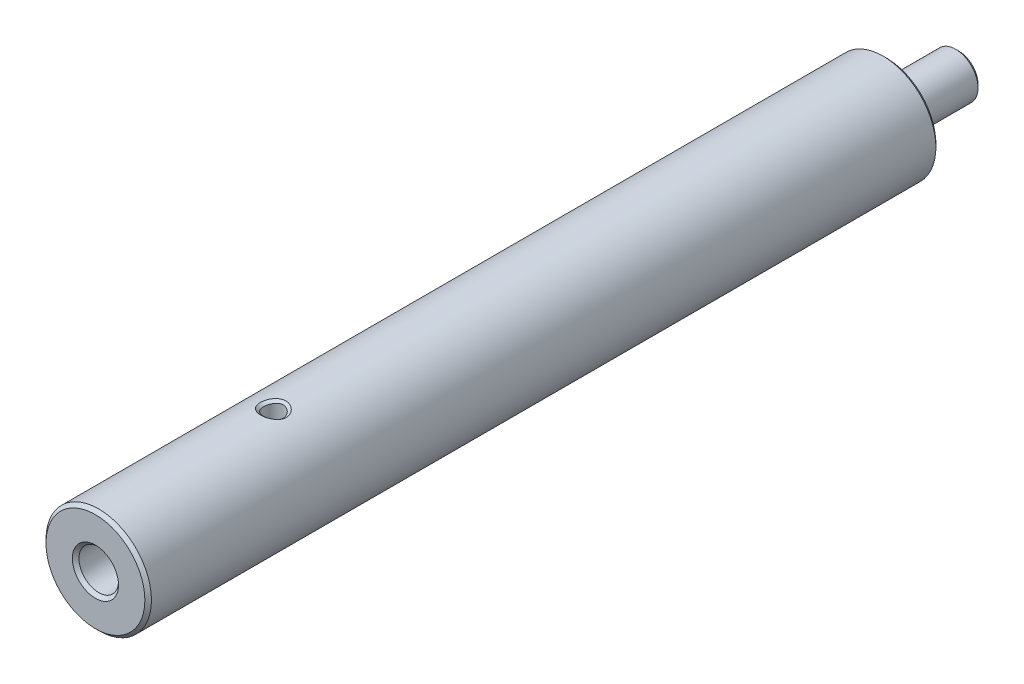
ISO-10303-21;
HEADER;
FILE_DESCRIPTION(('STEP AP214'),'2;1');
FILE_NAME('part.step','',(''),(''),'','','');
FILE_SCHEMA(('AUTOMOTIVE_DESIGN { 1 0 10303 214 1 1 1 1 }'));
ENDSEC;
DATA;
#1=APPLICATION_CONTEXT('core data for automotive mechanical design processes');
#2=APPLICATION_PROTOCOL_DEFINITION('international standard','automotive_design',2000,#1);
#3=PRODUCT_CONTEXT('',#1,'mechanical');
#4=PRODUCT('Part','Part','',(#3));
#5=PRODUCT_RELATED_PRODUCT_CATEGORY('part','',(#4));
#6=PRODUCT_DEFINITION_FORMATION('','',#4);
#7=PRODUCT_DEFINITION_CONTEXT('part definition',#1,'design');
#8=PRODUCT_DEFINITION('design','',#6,#7);
#9=PRODUCT_DEFINITION_SHAPE('','',#8);
#10=(LENGTH_UNIT() NAMED_UNIT(*) SI_UNIT(.MILLI.,.METRE.));
#11=(NAMED_UNIT(*) PLANE_ANGLE_UNIT() SI_UNIT($,.RADIAN.));
#12=(NAMED_UNIT(*) SI_UNIT($,.STERADIAN.) SOLID_ANGLE_UNIT());
#13=UNCERTAINTY_MEASURE_WITH_UNIT(LENGTH_MEASURE(1.E-05),#10,'distance_accuracy_value','');
#14=(GEOMETRIC_REPRESENTATION_CONTEXT(3) GLOBAL_UNCERTAINTY_ASSIGNED_CONTEXT((#13)) GLOBAL_UNIT_ASSIGNED_CONTEXT((#10,
#11,#12)) REPRESENTATION_CONTEXT('',''));
#15=CARTESIAN_POINT('',(0.,0.,0.));
#16=DIRECTION('',(0.,0.,1.));
#17=DIRECTION('',(1.,0.,0.));
#18=AXIS2_PLACEMENT_3D('',#15,#16,#17);
#19=CARTESIAN_POINT('',(0.,0.,0.));
#20=DIRECTION('',(0.,0.,1.));
#21=DIRECTION('',(1.,0.,0.));
#22=AXIS2_PLACEMENT_3D('',#19,#20,#21);
#23=PLANE('',#22);
#24=CARTESIAN_POINT('',(0.,0.,0.));
#25=DIRECTION('',(0.,0.,1.));
#26=DIRECTION('',(1.,0.,0.));
#27=AXIS2_PLACEMENT_3D('',#24,#25,#26);
#28=CIRCLE('',#27,1.24999999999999);
#29=CARTESIAN_POINT('',(1.24999999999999,0.,0.));
#30=VERTEX_POINT('',#29);
#31=EDGE_CURVE('E43',#30,#30,#28,.T.);
#32=ORIENTED_EDGE('',*,*,#31,.T.);
#33=EDGE_LOOP('',(#32));
#34=FACE_BOUND('',#33,.T.);
#35=ADVANCED_FACE('F29',(#34),#23,.T.);
#36=CARTESIAN_POINT('',(0.,0.,-50.5));
#37=DIRECTION('',(0.,0.,-1.));
#38=DIRECTION('',(-1.,0.,0.));
#39=AXIS2_PLACEMENT_3D('',#36,#37,#38);
#40=CYLINDRICAL_SURFACE('',#39,1.49999999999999);
#41=CARTESIAN_POINT('',(0.,0.,14.75));
#42=DIRECTION('',(0.,0.,1.));
#43=DIRECTION('',(1.,0.,0.));
#44=AXIS2_PLACEMENT_3D('',#41,#42,#43);
#45=CIRCLE('',#44,1.49999999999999);
#46=CARTESIAN_POINT('',(1.49999999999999,0.,14.75));
#47=VERTEX_POINT('',#46);
#48=EDGE_CURVE('E272',#47,#47,#45,.T.);
#49=ORIENTED_EDGE('',*,*,#48,.T.);
#50=EDGE_LOOP('',(#49));
#51=FACE_BOUND('',#50,.T.);
#52=CARTESIAN_POINT('',(0.,0.,0.25));
#53=DIRECTION('',(0.,0.,1.));
#54=DIRECTION('',(1.,0.,0.));
#55=AXIS2_PLACEMENT_3D('',#52,#53,#54);
#56=CIRCLE('',#55,1.49999999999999);
#57=CARTESIAN_POINT('',(1.49999999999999,0.,0.25));
#58=VERTEX_POINT('',#57);
#59=EDGE_CURVE('E180',#58,#58,#56,.F.);
#60=ORIENTED_EDGE('',*,*,#59,.T.);
#61=EDGE_LOOP('',(#60));
#62=FACE_BOUND('',#61,.T.);
#63=CARTESIAN_POINT('',(0.,1.49999999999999,2.5));
#64=CARTESIAN_POINT('',(-0.470782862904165,1.50017981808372,2.50029199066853));
#65=CARTESIAN_POINT('',(-0.857186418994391,1.23092982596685,2.04722669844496));
#66=CARTESIAN_POINT('',(-0.857099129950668,1.23102570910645,0.95189489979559));
#67=CARTESIAN_POINT('',(-0.470693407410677,1.50038152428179,0.499309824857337));
#68=CARTESIAN_POINT('',(0.472895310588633,1.49961766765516,0.500691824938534));
#69=CARTESIAN_POINT('',(0.857125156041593,1.23074760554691,0.954156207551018));
#70=CARTESIAN_POINT('',(0.857159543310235,1.23120852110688,2.04802010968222));
#71=CARTESIAN_POINT('',(0.470782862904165,1.49982018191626,2.49970800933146));
#72=CARTESIAN_POINT('',(0.,1.49999999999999,2.5));
#73=B_SPLINE_CURVE_WITH_KNOTS('',3,(#63,#64,#65,#66,#67,#68,#69,#70,#71,#72),.UNSPECIFIED.,.T.,
.F.,(4,2,2,2,4),(-0.0062479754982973,-0.0046508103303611,-0.00305364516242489,
-0.00145647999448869,0.000140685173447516),.UNSPECIFIED.);
#74=CARTESIAN_POINT('',(0.,1.49999999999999,2.5));
#75=VERTEX_POINT('',#74);
#76=EDGE_CURVE('E178',#75,#75,#73,.F.);
#77=ORIENTED_EDGE('',*,*,#76,.T.);
#78=EDGE_LOOP('',(#77));
#79=FACE_BOUND('',#78,.T.);
#80=CARTESIAN_POINT('',(0.,-1.49999999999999,2.5));
#81=CARTESIAN_POINT('',(0.470782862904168,-1.50017981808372,2.50029199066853));
#82=CARTESIAN_POINT('',(0.857186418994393,-1.23092982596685,2.04722669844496));
#83=CARTESIAN_POINT('',(0.857099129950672,-1.23102570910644,0.951894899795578));
#84=CARTESIAN_POINT('',(0.470693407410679,-1.50038152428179,0.499309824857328));
#85=CARTESIAN_POINT('',(-0.472895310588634,-1.49961766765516,0.500691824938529));
#86=CARTESIAN_POINT('',(-0.857125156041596,-1.23074760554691,0.95415620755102));
#87=CARTESIAN_POINT('',(-0.857159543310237,-1.23120852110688,2.04802010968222));
#88=CARTESIAN_POINT('',(-0.470782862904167,-1.49982018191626,2.49970800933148));
#89=CARTESIAN_POINT('',(0.,-1.49999999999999,2.5));
#90=B_SPLINE_CURVE_WITH_KNOTS('',3,(#80,#81,#82,#83,#84,#85,#86,#87,#88,#89),.UNSPECIFIED.,.T.,
.F.,(4,2,2,2,4),(-0.00624797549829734,-0.00465081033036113,-0.00305364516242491,
-0.0014564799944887,0.000140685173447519),.UNSPECIFIED.);
#91=CARTESIAN_POINT('',(0.,-1.49999999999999,2.5));
#92=VERTEX_POINT('',#91);
#93=EDGE_CURVE('E175',#92,#92,#90,.F.);
#94=ORIENTED_EDGE('',*,*,#93,.T.);
#95=EDGE_LOOP('',(#94));
#96=FACE_BOUND('',#95,.T.);
#97=ADVANCED_FACE('F248',(#51,#62,#79,#96),#40,.F.);
#98=CARTESIAN_POINT('',(0.,1.49999999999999,15.));
#99=DIRECTION('',(0.,0.,1.));
#100=DIRECTION('',(1.,0.,0.));
#101=AXIS2_PLACEMENT_3D('',#98,#99,#100);
#102=PLANE('',#101);
#103=CARTESIAN_POINT('',(0.,0.,15.));
#104=DIRECTION('',(0.,0.,1.));
#105=DIRECTION('',(1.,0.,0.));
#106=AXIS2_PLACEMENT_3D('',#103,#104,#105);
#107=CIRCLE('',#106,3.75);
#108=CARTESIAN_POINT('',(3.75,0.,15.));
#109=VERTEX_POINT('',#108);
#110=EDGE_CURVE('E187',#109,#109,#107,.T.);
#111=ORIENTED_EDGE('',*,*,#110,.T.);
#112=EDGE_LOOP('',(#111));
#113=FACE_BOUND('',#112,.T.);
#114=CARTESIAN_POINT('',(0.,0.,15.));
#115=DIRECTION('',(0.,0.,1.));
#116=DIRECTION('',(1.,0.,0.));
#117=AXIS2_PLACEMENT_3D('',#114,#115,#116);
#118=CIRCLE('',#117,1.74999999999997);
#119=CARTESIAN_POINT('',(1.74999999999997,0.,15.));
#120=VERTEX_POINT('',#119);
#121=EDGE_CURVE('E191',#120,#120,#118,.F.);
#122=ORIENTED_EDGE('',*,*,#121,.T.);
#123=EDGE_LOOP('',(#122));
#124=FACE_BOUND('',#123,.T.);
#125=ADVANCED_FACE('F258',(#113,#124),#102,.T.);
#126=CARTESIAN_POINT('',(0.,0.,-50.5));
#127=DIRECTION('',(0.,0.,-1.));
#128=DIRECTION('',(-1.,0.,0.));
#129=AXIS2_PLACEMENT_3D('',#126,#127,#128);
#130=CYLINDRICAL_SURFACE('',#129,3.99999999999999);
#131=CARTESIAN_POINT('',(0.,0.,-44.75));
#132=DIRECTION('',(0.,0.,-1.));
#133=DIRECTION('',(-1.,0.,0.));
#134=AXIS2_PLACEMENT_3D('',#131,#132,#133);
#135=CIRCLE('',#134,3.99999999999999);
#136=CARTESIAN_POINT('',(-3.99999999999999,0.,-44.75));
#137=VERTEX_POINT('',#136);
#138=EDGE_CURVE('E196',#137,#137,#135,.F.);
#139=ORIENTED_EDGE('',*,*,#138,.T.);
#140=EDGE_LOOP('',(#139));
#141=FACE_BOUND('',#140,.T.);
#142=CARTESIAN_POINT('',(0.,0.,14.75));
#143=DIRECTION('',(0.,0.,1.));
#144=DIRECTION('',(1.,0.,0.));
#145=AXIS2_PLACEMENT_3D('',#142,#143,#144);
#146=CIRCLE('',#145,3.99999999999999);
#147=CARTESIAN_POINT('',(3.99999999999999,0.,14.75));
#148=VERTEX_POINT('',#147);
#149=EDGE_CURVE('E422',#148,#148,#146,.F.);
#150=ORIENTED_EDGE('',*,*,#149,.T.);
#151=EDGE_LOOP('',(#150));
#152=FACE_BOUND('',#151,.T.);
#153=CARTESIAN_POINT('',(0.,3.99999999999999,2.44596063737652));
#154=CARTESIAN_POINT('',(0.529767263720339,4.00000418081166,2.44593168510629));
#155=CARTESIAN_POINT('',(0.986968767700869,3.87636399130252,2.00797754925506));
#156=CARTESIAN_POINT('',(0.986931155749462,3.87629484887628,0.992599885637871));
#157=CARTESIAN_POINT('',(0.530695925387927,3.9999960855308,0.554032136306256));
#158=CARTESIAN_POINT('',(-0.530811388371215,4.00000391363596,0.554046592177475));
#159=CARTESIAN_POINT('',(-0.986852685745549,3.87629943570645,0.992987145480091));
#160=CARTESIAN_POINT('',(-0.987046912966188,3.87635948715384,2.00824214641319));
#161=CARTESIAN_POINT('',(-0.529767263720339,3.99999581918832,2.44598958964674));
#162=CARTESIAN_POINT('',(0.,3.99999999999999,2.44596063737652));
#163=B_SPLINE_CURVE_WITH_KNOTS('',3,(#153,#154,#155,#156,#157,#158,#159,#160,#161,#162),
.UNSPECIFIED.,.T.,.F.,(4,2,2,2,4),(-0.00592829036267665,-0.00444372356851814,
-0.00295915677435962,-0.00147458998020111,9.97681395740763E-06),.UNSPECIFIED.);
#164=CARTESIAN_POINT('',(0.,3.99999999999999,2.44596063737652));
#165=VERTEX_POINT('',#164);
#166=EDGE_CURVE('E424',#165,#165,#163,.F.);
#167=ORIENTED_EDGE('',*,*,#166,.T.);
#168=EDGE_LOOP('',(#167));
#169=FACE_BOUND('',#168,.T.);
#170=CARTESIAN_POINT('',(0.,-3.99999999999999,2.44596063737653));
#171=CARTESIAN_POINT('',(-0.529767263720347,-4.00000418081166,2.44593168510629));
#172=CARTESIAN_POINT('',(-0.98696876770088,-3.87636399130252,2.00797754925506));
#173=CARTESIAN_POINT('',(-0.986931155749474,-3.87629484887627,0.992599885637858));
#174=CARTESIAN_POINT('',(-0.530695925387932,-3.9999960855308,0.554032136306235));
#175=CARTESIAN_POINT('',(0.530811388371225,-4.00000391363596,0.554046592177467));
#176=CARTESIAN_POINT('',(0.986852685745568,-3.87629943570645,0.992987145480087));
#177=CARTESIAN_POINT('',(0.987046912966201,-3.87635948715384,2.00824214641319));
#178=CARTESIAN_POINT('',(0.529767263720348,-3.99999581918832,2.44598958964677));
#179=CARTESIAN_POINT('',(0.,-3.99999999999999,2.44596063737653));
#180=B_SPLINE_CURVE_WITH_KNOTS('',3,(#170,#171,#172,#173,#174,#175,#176,#177,#178,#179),
.UNSPECIFIED.,.T.,.F.,(4,2,2,2,4),(-0.00592829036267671,-0.00444372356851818,
-0.00295915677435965,-0.00147458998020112,9.9768139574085E-06),.UNSPECIFIED.);
#181=CARTESIAN_POINT('',(0.,-3.99999999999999,2.44596063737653));
#182=VERTEX_POINT('',#181);
#183=EDGE_CURVE('E109',#182,#182,#180,.F.);
#184=ORIENTED_EDGE('',*,*,#183,.T.);
#185=EDGE_LOOP('',(#184));
#186=FACE_BOUND('',#185,.T.);
#187=ADVANCED_FACE('F301',(#141,#152,#169,#186),#130,.T.);
#188=CARTESIAN_POINT('',(0.,3.99999999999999,-45.));
#189=DIRECTION('',(0.,0.,-1.));
#190=DIRECTION('',(-1.,0.,0.));
#191=AXIS2_PLACEMENT_3D('',#188,#189,#190);
#192=PLANE('',#191);
#193=CARTESIAN_POINT('',(0.,0.,-45.));
#194=DIRECTION('',(0.,0.,-1.));
#195=DIRECTION('',(-1.,0.,0.));
#196=AXIS2_PLACEMENT_3D('',#193,#194,#195);
#197=CIRCLE('',#196,3.75);
#198=CARTESIAN_POINT('',(-3.75,0.,-45.));
#199=VERTEX_POINT('',#198);
#200=EDGE_CURVE('E450',#199,#199,#197,.T.);
#201=ORIENTED_EDGE('',*,*,#200,.T.);
#202=EDGE_LOOP('',(#201));
#203=FACE_BOUND('',#202,.T.);
#204=CARTESIAN_POINT('',(0.,0.,-45.));
#205=DIRECTION('',(0.,0.,-1.));
#206=DIRECTION('',(-1.,0.,0.));
#207=AXIS2_PLACEMENT_3D('',#204,#205,#206);
#208=CIRCLE('',#207,1.7);
#209=CARTESIAN_POINT('',(-1.7,0.,-45.));
#210=VERTEX_POINT('',#209);
#211=EDGE_CURVE('E453',#210,#210,#208,.T.);
#212=ORIENTED_EDGE('',*,*,#211,.F.);
#213=EDGE_LOOP('',(#212));
#214=FACE_BOUND('',#213,.T.);
#215=ADVANCED_FACE('F307',(#203,#214),#192,.T.);
#216=CARTESIAN_POINT('',(0.,0.,-50.5));
#217=DIRECTION('',(0.,0.,-1.));
#218=DIRECTION('',(-1.,0.,0.));
#219=AXIS2_PLACEMENT_3D('',#216,#217,#218);
#220=CYLINDRICAL_SURFACE('',#219,1.7);
#221=CARTESIAN_POINT('',(0.,0.,-50.25));
#222=DIRECTION('',(0.,0.,-1.));
#223=DIRECTION('',(-1.,0.,0.));
#224=AXIS2_PLACEMENT_3D('',#221,#222,#223);
#225=CIRCLE('',#224,1.7);
#226=CARTESIAN_POINT('',(-1.7,0.,-50.25));
#227=VERTEX_POINT('',#226);
#228=EDGE_CURVE('E10',#227,#227,#225,.F.);
#229=ORIENTED_EDGE('',*,*,#228,.T.);
#230=EDGE_LOOP('',(#229));
#231=FACE_BOUND('',#230,.T.);
#232=ORIENTED_EDGE('',*,*,#211,.T.);
#233=EDGE_LOOP('',(#232));
#234=FACE_BOUND('',#233,.T.);
#235=ADVANCED_FACE('F314',(#231,#234),#220,.T.);
#236=CARTESIAN_POINT('',(0.,1.7,-50.5));
#237=DIRECTION('',(0.,0.,-1.));
#238=DIRECTION('',(-1.,0.,0.));
#239=AXIS2_PLACEMENT_3D('',#236,#237,#238);
#240=PLANE('',#239);
#241=CARTESIAN_POINT('',(0.,0.,-50.5));
#242=DIRECTION('',(0.,0.,-1.));
#243=DIRECTION('',(-1.,0.,0.));
#244=AXIS2_PLACEMENT_3D('',#241,#242,#243);
#245=CIRCLE('',#244,1.45000000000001);
#246=CARTESIAN_POINT('',(-1.45000000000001,0.,-50.5));
#247=VERTEX_POINT('',#246);
#248=EDGE_CURVE('E38',#247,#247,#245,.T.);
#249=ORIENTED_EDGE('',*,*,#248,.T.);
#250=EDGE_LOOP('',(#249));
#251=FACE_BOUND('',#250,.T.);
#252=ADVANCED_FACE('F214',(#251),#240,.T.);
#253=CARTESIAN_POINT('',(0.,-5.,1.50000000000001));
#254=DIRECTION('',(0.,1.,0.));
#255=DIRECTION('',(0.,0.,1.));
#256=AXIS2_PLACEMENT_3D('',#253,#254,#255);
#257=CYLINDRICAL_SURFACE('',#256,0.750000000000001);
#258=CARTESIAN_POINT('',(0.,3.83387458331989,2.25000000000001));
#259=CARTESIAN_POINT('',(-0.0125312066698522,3.83387479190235,2.25000153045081));
#260=CARTESIAN_POINT('',(-0.0250619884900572,3.83375953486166,2.24966517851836));
#261=CARTESIAN_POINT('',(-0.0499976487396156,3.8333105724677,2.24832779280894));
#262=CARTESIAN_POINT('',(-0.0624028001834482,3.83297837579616,2.24733134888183));
#263=CARTESIAN_POINT('',(-0.087068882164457,3.83211006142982,2.24469182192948));
#264=CARTESIAN_POINT('',(-0.0993302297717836,3.83157505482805,2.24305226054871));
#265=CARTESIAN_POINT('',(-0.123690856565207,3.83031606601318,2.23914559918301));
#266=CARTESIAN_POINT('',(-0.135790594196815,3.82959286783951,2.23688110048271));
#267=CARTESIAN_POINT('',(-0.159810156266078,3.82797223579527,2.23174318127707));
#268=CARTESIAN_POINT('',(-0.171730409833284,3.8270753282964,2.22887159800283));
#269=CARTESIAN_POINT('',(-0.195373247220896,3.82512198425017,2.22253805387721));
#270=CARTESIAN_POINT('',(-0.207096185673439,3.82406587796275,2.21907731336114));
#271=CARTESIAN_POINT('',(-0.230326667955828,3.82180877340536,2.21158382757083));
#272=CARTESIAN_POINT('',(-0.241834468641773,3.82060796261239,2.20755182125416));
#273=CARTESIAN_POINT('',(-0.26461696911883,3.81807603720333,2.19893404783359));
#274=CARTESIAN_POINT('',(-0.275891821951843,3.81674501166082,2.19434865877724));
#275=CARTESIAN_POINT('',(-0.29819072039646,3.81396720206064,2.1846422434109));
#276=CARTESIAN_POINT('',(-0.309214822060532,3.81252044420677,2.17952133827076));
#277=CARTESIAN_POINT('',(-0.33099450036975,3.80952568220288,2.1687619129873));
#278=CARTESIAN_POINT('',(-0.341750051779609,3.80797766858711,2.16312334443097));
#279=CARTESIAN_POINT('',(-0.36297489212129,3.80479488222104,2.15134652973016));
#280=CARTESIAN_POINT('',(-0.37344409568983,3.80316008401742,2.14520813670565));
#281=CARTESIAN_POINT('',(-0.394078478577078,3.79981819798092,2.13244954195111));
#282=CARTESIAN_POINT('',(-0.404243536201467,3.79811108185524,2.12582915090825));
#283=CARTESIAN_POINT('',(-0.42425183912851,3.79463901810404,2.11212437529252));
#284=CARTESIAN_POINT('',(-0.434094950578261,3.79287404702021,2.10503980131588));
#285=CARTESIAN_POINT('',(-0.453441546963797,3.78930072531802,2.09042443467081));
#286=CARTESIAN_POINT('',(-0.462944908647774,3.78749235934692,2.08289348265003));
#287=CARTESIAN_POINT('',(-0.481594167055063,3.78384669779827,2.06740310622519));
#288=CARTESIAN_POINT('',(-0.490739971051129,3.7820093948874,2.05944357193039));
#289=CARTESIAN_POINT('',(-0.508656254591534,3.77832031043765,2.04311375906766));
#290=CARTESIAN_POINT('',(-0.517426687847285,3.77646852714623,2.0347434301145));
#291=CARTESIAN_POINT('',(-0.534574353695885,3.77276493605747,2.01760974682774));
#292=CARTESIAN_POINT('',(-0.542951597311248,3.77091312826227,2.00884640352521));
#293=CARTESIAN_POINT('',(-0.55929499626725,3.7672239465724,1.99094440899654));
#294=CARTESIAN_POINT('',(-0.567261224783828,3.76538657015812,1.98180582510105));
#295=CARTESIAN_POINT('',(-0.582764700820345,3.76174071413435,1.96317107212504));
#296=CARTESIAN_POINT('',(-0.59030208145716,3.75993222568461,1.95367501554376));
#297=CARTESIAN_POINT('',(-0.604929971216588,3.75635861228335,1.9343430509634));
#298=CARTESIAN_POINT('',(-0.612020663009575,3.75459346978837,1.92450728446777));
#299=CARTESIAN_POINT('',(-0.625737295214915,3.75112101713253,1.90451364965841));
#300=CARTESIAN_POINT('',(-0.632363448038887,3.7494136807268,1.89435593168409));
#301=CARTESIAN_POINT('',(-0.645133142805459,3.74607130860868,1.87373616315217));
#302=CARTESIAN_POINT('',(-0.651276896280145,3.74443624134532,1.86327424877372));
#303=CARTESIAN_POINT('',(-0.663063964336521,3.74125287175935,1.84206387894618));
#304=CARTESIAN_POINT('',(-0.668707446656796,3.73970454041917,1.83131552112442));
#305=CARTESIAN_POINT('',(-0.679476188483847,3.73670909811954,1.80955007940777));
#306=CARTESIAN_POINT('',(-0.684601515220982,3.73526197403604,1.7985330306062));
#307=CARTESIAN_POINT('',(-0.694316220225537,3.73248338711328,1.77624804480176));
#308=CARTESIAN_POINT('',(-0.698905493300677,3.73115194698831,1.76498005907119));
#309=CARTESIAN_POINT('',(-0.707530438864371,3.72861914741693,1.74221105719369));
#310=CARTESIAN_POINT('',(-0.711565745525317,3.72741787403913,1.73070989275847));
#311=CARTESIAN_POINT('',(-0.719065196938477,3.72515979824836,1.70749240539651));
#312=CARTESIAN_POINT('',(-0.722528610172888,3.7241031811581,1.69577582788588));
#313=CARTESIAN_POINT('',(-0.728866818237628,3.72214877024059,1.67214539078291));
#314=CARTESIAN_POINT('',(-0.731740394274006,3.72125130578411,1.66023117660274));
#315=CARTESIAN_POINT('',(-0.736881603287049,3.71962950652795,1.63622333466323));
#316=CARTESIAN_POINT('',(-0.739147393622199,3.7189056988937,1.62412927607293));
#317=CARTESIAN_POINT('',(-0.743055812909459,3.71764546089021,1.59977958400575));
#318=CARTESIAN_POINT('',(-0.744695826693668,3.71710981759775,1.58752348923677));
#319=CARTESIAN_POINT('',(-0.74733574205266,3.71624010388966,1.56286752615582));
#320=CARTESIAN_POINT('',(-0.748332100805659,3.71590714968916,1.55046723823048));
#321=CARTESIAN_POINT('',(-0.749667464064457,3.71545689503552,1.52554057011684));
#322=CARTESIAN_POINT('',(-0.750001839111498,3.71534111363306,1.51301391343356));
#323=CARTESIAN_POINT('',(-0.749997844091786,3.71533938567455,1.48795973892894));
#324=CARTESIAN_POINT('',(-0.749659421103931,3.71545345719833,1.47543222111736));
#325=CARTESIAN_POINT('',(-0.748318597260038,3.71590054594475,1.45050208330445));
#326=CARTESIAN_POINT('',(-0.747320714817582,3.71623207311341,1.43809919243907));
#327=CARTESIAN_POINT('',(-0.744679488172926,3.71709910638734,1.41343639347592));
#328=CARTESIAN_POINT('',(-0.743039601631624,3.71763351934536,1.4011760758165));
#329=CARTESIAN_POINT('',(-0.739133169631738,3.7188914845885,1.37681641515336));
#330=CARTESIAN_POINT('',(-0.736869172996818,3.71961426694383,1.3647166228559));
#331=CARTESIAN_POINT('',(-0.731733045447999,3.72123419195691,1.34069590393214));
#332=CARTESIAN_POINT('',(-0.728862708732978,3.72213081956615,1.328774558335));
#333=CARTESIAN_POINT('',(-0.722532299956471,3.72408372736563,1.30512856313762));
#334=CARTESIAN_POINT('',(-0.719073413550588,3.72513968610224,1.29340356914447));
#335=CARTESIAN_POINT('',(-0.711584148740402,3.72739660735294,1.27016806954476));
#336=CARTESIAN_POINT('',(-0.707554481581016,3.72859738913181,1.25865731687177));
#337=CARTESIAN_POINT('',(-0.698941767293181,3.73112935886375,1.23586807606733));
#338=CARTESIAN_POINT('',(-0.694359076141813,3.73246046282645,1.22458944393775));
#339=CARTESIAN_POINT('',(-0.684658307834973,3.73523852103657,1.20228222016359));
#340=CARTESIAN_POINT('',(-0.679540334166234,3.73668545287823,1.19125358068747));
#341=CARTESIAN_POINT('',(-0.668786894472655,3.73968064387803,1.16946412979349));
#342=CARTESIAN_POINT('',(-0.663151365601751,3.74122891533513,1.1587033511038));
#343=CARTESIAN_POINT('',(-0.651380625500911,3.74441228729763,1.13746742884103));
#344=CARTESIAN_POINT('',(-0.645245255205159,3.74604741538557,1.12699237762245));
#345=CARTESIAN_POINT('',(-0.632492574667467,3.74939001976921,1.10634574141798));
#346=CARTESIAN_POINT('',(-0.625875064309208,3.75109752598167,1.09617428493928));
#347=CARTESIAN_POINT('',(-0.612175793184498,3.75457041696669,1.07615269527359));
#348=CARTESIAN_POINT('',(-0.605093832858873,3.75633582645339,1.06630270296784));
#349=CARTESIAN_POINT('',(-0.590483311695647,3.75991006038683,1.04694192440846));
#350=CARTESIAN_POINT('',(-0.582954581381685,3.76171890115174,1.03743126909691));
#351=CARTESIAN_POINT('',(-0.567468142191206,3.76536553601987,1.01876707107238));
#352=CARTESIAN_POINT('',(-0.559510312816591,3.7672033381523,1.00961362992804));
#353=CARTESIAN_POINT('',(-0.543183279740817,3.77089343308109,0.991681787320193));
#354=CARTESIAN_POINT('',(-0.534814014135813,3.77274572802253,0.982903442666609));
#355=CARTESIAN_POINT('',(-0.517681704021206,3.77645034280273,0.965739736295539));
#356=CARTESIAN_POINT('',(-0.508918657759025,3.77830266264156,0.957354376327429));
#357=CARTESIAN_POINT('',(-0.491016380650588,3.78199285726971,0.940994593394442));
#358=CARTESIAN_POINT('',(-0.481877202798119,3.78383073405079,0.933020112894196));
#359=CARTESIAN_POINT('',(-0.46324026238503,3.7874775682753,0.917500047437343));
#360=CARTESIAN_POINT('',(-0.453742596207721,3.78928653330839,0.909954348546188));
#361=CARTESIAN_POINT('',(-0.434406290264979,3.79286106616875,0.895309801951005));
#362=CARTESIAN_POINT('',(-0.424567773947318,3.79462664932,0.88821079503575));
#363=CARTESIAN_POINT('',(-0.404567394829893,3.79809993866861,0.874477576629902));
#364=CARTESIAN_POINT('',(-0.394405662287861,3.79980766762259,0.867843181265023));
#365=CARTESIAN_POINT('',(-0.373776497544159,3.80315076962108,0.855057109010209));
#366=CARTESIAN_POINT('',(-0.363309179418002,3.80478616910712,0.848905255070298));
#367=CARTESIAN_POINT('',(-0.342086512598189,3.807970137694,0.837102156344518));
#368=CARTESIAN_POINT('',(-0.331331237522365,3.80951872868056,0.831450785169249));
#369=CARTESIAN_POINT('',(-0.309550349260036,3.81251461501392,0.820666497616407));
#370=CARTESIAN_POINT('',(-0.298524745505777,3.81396191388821,0.81553356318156));
#371=CARTESIAN_POINT('',(-0.276220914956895,3.81674076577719,0.805803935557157));
#372=CARTESIAN_POINT('',(-0.264942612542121,3.81807228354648,0.801207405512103));
#373=CARTESIAN_POINT('',(-0.242151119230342,3.82060514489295,0.792568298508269));
#374=CARTESIAN_POINT('',(-0.230637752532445,3.82180638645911,0.788526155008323));
#375=CARTESIAN_POINT('',(-0.207393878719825,3.82406429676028,0.781013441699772));
#376=CARTESIAN_POINT('',(-0.195663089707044,3.82512076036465,0.777543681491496));
#377=CARTESIAN_POINT('',(-0.172002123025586,3.82707475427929,0.771193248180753));
#378=CARTESIAN_POINT('',(-0.160071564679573,3.82797193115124,0.768313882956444));
#379=CARTESIAN_POINT('',(-0.136028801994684,3.8295930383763,0.763161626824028));
#380=CARTESIAN_POINT('',(-0.123916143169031,3.83031641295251,0.760890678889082));
#381=CARTESIAN_POINT('',(-0.099526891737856,3.8315756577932,0.75697251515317));
#382=CARTESIAN_POINT('',(-0.0872498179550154,3.83211070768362,0.755328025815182));
#383=CARTESIAN_POINT('',(-0.0625494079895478,3.83297911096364,0.752679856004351));
#384=CARTESIAN_POINT('',(-0.0501256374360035,3.83331131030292,0.751679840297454));
#385=CARTESIAN_POINT('',(-0.0251493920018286,3.83375988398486,0.75033766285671));
#386=CARTESIAN_POINT('',(-0.0125966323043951,3.83387469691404,0.750000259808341));
#387=CARTESIAN_POINT('',(0.0125090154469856,3.83387446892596,0.749999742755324));
#388=CARTESIAN_POINT('',(0.0250619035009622,3.83375942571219,0.750336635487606));
#389=CARTESIAN_POINT('',(0.0500386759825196,3.83331042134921,0.751677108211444));
#390=CARTESIAN_POINT('',(0.0624628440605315,3.83297801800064,0.752675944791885));
#391=CARTESIAN_POINT('',(0.0871642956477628,3.83210922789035,0.755321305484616));
#392=CARTESIAN_POINT('',(0.0994420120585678,3.83157399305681,0.756964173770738));
#393=CARTESIAN_POINT('',(0.123832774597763,3.83031439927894,0.760878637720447));
#394=CARTESIAN_POINT('',(0.135946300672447,3.82959085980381,0.763147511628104));
#395=CARTESIAN_POINT('',(0.159991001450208,3.82796944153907,0.768295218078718));
#396=CARTESIAN_POINT('',(0.171922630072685,3.82707211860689,0.771172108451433));
#397=CARTESIAN_POINT('',(0.195585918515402,3.82511784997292,0.77751722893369));
#398=CARTESIAN_POINT('',(0.207317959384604,3.82406125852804,0.780984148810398));
#399=CARTESIAN_POINT('',(0.230564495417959,3.82180310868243,0.788490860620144));
#400=CARTESIAN_POINT('',(0.242079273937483,3.82060175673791,0.792529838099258));
#401=CARTESIAN_POINT('',(0.264873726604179,3.81806868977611,0.801162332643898));
#402=CARTESIAN_POINT('',(0.276153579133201,3.81673707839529,0.805755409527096));
#403=CARTESIAN_POINT('',(0.298460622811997,3.81395805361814,0.815477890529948));
#404=CARTESIAN_POINT('',(0.309487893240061,3.81251067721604,0.82060712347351));
#405=CARTESIAN_POINT('',(0.33127220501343,3.80951464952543,0.83138380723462));
#406=CARTESIAN_POINT('',(0.342029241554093,3.80796599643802,0.837031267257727));
#407=CARTESIAN_POINT('',(0.363255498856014,3.80478191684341,0.848826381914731));
#408=CARTESIAN_POINT('',(0.373724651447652,3.80314647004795,0.854974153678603));
#409=CARTESIAN_POINT('',(0.394357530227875,3.79980328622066,0.867751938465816));
#410=CARTESIAN_POINT('',(0.404521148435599,3.79809552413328,0.874382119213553));
#411=CARTESIAN_POINT('',(0.42452532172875,3.79462218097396,0.888106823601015));
#412=CARTESIAN_POINT('',(0.434365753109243,3.79285657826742,0.895201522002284));
#413=CARTESIAN_POINT('',(0.45370588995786,3.7892820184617,0.909837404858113));
#414=CARTESIAN_POINT('',(0.463205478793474,3.78747304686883,0.917378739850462));
#415=CARTESIAN_POINT('',(0.481846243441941,3.78382621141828,0.932890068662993));
#416=CARTESIAN_POINT('',(0.490987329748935,3.78198834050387,0.940860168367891));
#417=CARTESIAN_POINT('',(0.508893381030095,3.77829816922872,0.957211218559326));
#418=CARTESIAN_POINT('',(0.517658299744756,3.77644586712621,0.96559221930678));
#419=CARTESIAN_POINT('',(0.534794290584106,3.77274129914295,0.982747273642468));
#420=CARTESIAN_POINT('',(0.543165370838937,3.77088903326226,0.991521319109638));
#421=CARTESIAN_POINT('',(0.559495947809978,3.76719900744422,1.00944466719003));
#422=CARTESIAN_POINT('',(0.567455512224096,3.76536124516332,1.01859390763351));
#423=CARTESIAN_POINT('',(0.582945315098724,3.7617147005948,1.03724984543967));
#424=CARTESIAN_POINT('',(0.590475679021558,3.75990590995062,1.04675643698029));
#425=CARTESIAN_POINT('',(0.605089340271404,3.7563317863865,1.06610926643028));
#426=CARTESIAN_POINT('',(0.612172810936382,3.75456643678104,1.07595537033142));
#427=CARTESIAN_POINT('',(0.625874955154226,3.75109367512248,1.09596939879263));
#428=CARTESIAN_POINT('',(0.632493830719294,3.74938623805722,1.10613718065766));
#429=CARTESIAN_POINT('',(0.645249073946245,3.74604378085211,1.12677672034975));
#430=CARTESIAN_POINT('',(0.651385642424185,3.74440873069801,1.13724834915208));
#431=CARTESIAN_POINT('',(0.663158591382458,3.74122552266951,1.15847771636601));
#432=CARTESIAN_POINT('',(0.668795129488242,3.7396773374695,1.16923536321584));
#433=CARTESIAN_POINT('',(0.679550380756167,3.73668232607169,1.191018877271));
#434=CARTESIAN_POINT('',(0.684669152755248,3.73523548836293,1.20204471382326));
#435=CARTESIAN_POINT('',(0.694371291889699,3.73245762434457,1.2243466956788));
#436=CARTESIAN_POINT('',(0.698954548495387,3.73112662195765,1.23562289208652));
#437=CARTESIAN_POINT('',(0.70756814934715,3.72859485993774,1.25840766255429));
#438=CARTESIAN_POINT('',(0.711598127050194,3.72739418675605,1.26991638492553));
#439=CARTESIAN_POINT('',(0.719087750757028,3.72513748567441,1.29314826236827));
#440=CARTESIAN_POINT('',(0.722546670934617,3.72408164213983,1.30487166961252));
#441=CARTESIAN_POINT('',(0.728876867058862,3.72212896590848,1.32851496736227));
#442=CARTESIAN_POINT('',(0.731746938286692,3.72123245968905,1.34043520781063));
#443=CARTESIAN_POINT('',(0.736882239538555,3.71961277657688,1.36445423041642));
#444=CARTESIAN_POINT('',(0.739145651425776,3.71889012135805,1.37655343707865));
#445=CARTESIAN_POINT('',(0.743050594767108,3.71763240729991,1.40091247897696));
#446=CARTESIAN_POINT('',(0.74468954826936,3.71709812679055,1.41317276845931));
#447=CARTESIAN_POINT('',(0.747328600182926,3.71623135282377,1.43783610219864));
#448=CARTESIAN_POINT('',(0.748325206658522,3.71589996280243,1.45023955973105));
#449=CARTESIAN_POINT('',(0.749663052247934,3.71545314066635,1.47517146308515));
#450=CARTESIAN_POINT('',(0.749999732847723,3.71533921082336,1.48770018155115));
#451=CARTESIAN_POINT('',(0.750000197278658,3.71534120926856,1.51275718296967));
#452=CARTESIAN_POINT('',(0.749664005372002,3.71545712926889,1.5252854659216));
#453=CARTESIAN_POINT('',(0.748325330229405,3.71590765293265,1.55021559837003));
#454=CARTESIAN_POINT('',(0.747327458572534,3.71624074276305,1.56261772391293));
#455=CARTESIAN_POINT('',(0.744684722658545,3.71711072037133,1.58727755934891));
#456=CARTESIAN_POINT('',(0.743043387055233,3.71764649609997,1.59953568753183));
#457=CARTESIAN_POINT('',(0.739132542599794,3.71890699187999,1.62388963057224));
#458=CARTESIAN_POINT('',(0.736865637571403,3.71963092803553,1.63598590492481));
#459=CARTESIAN_POINT('',(0.73172239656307,3.72125297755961,1.65999834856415));
#460=CARTESIAN_POINT('',(0.72884789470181,3.72215056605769,1.67191494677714));
#461=CARTESIAN_POINT('',(0.722508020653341,3.72410521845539,1.6955503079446));
#462=CARTESIAN_POINT('',(0.719043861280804,3.72516195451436,1.70726942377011));
#463=CARTESIAN_POINT('',(0.711543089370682,3.72742026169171,1.73049212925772));
#464=CARTESIAN_POINT('',(0.707507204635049,3.7286216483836,1.74199597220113));
#465=CARTESIAN_POINT('',(0.698881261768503,3.7311546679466,1.7647704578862));
#466=CARTESIAN_POINT('',(0.694291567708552,3.73248621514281,1.77604124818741));
#467=CARTESIAN_POINT('',(0.684576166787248,3.73526500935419,1.79833195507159));
#468=CARTESIAN_POINT('',(0.679450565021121,3.73671223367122,1.80935192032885));
#469=CARTESIAN_POINT('',(0.668681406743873,3.73970786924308,1.83112329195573));
#470=CARTESIAN_POINT('',(0.663037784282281,3.74125629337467,1.84187466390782));
#471=CARTESIAN_POINT('',(0.651250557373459,3.74443984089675,1.86309114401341));
#472=CARTESIAN_POINT('',(0.645106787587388,3.74607499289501,1.87355615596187));
#473=CARTESIAN_POINT('',(0.63233716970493,3.74941752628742,1.89418218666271));
#474=CARTESIAN_POINT('',(0.625711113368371,3.7511249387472,1.90434307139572));
#475=CARTESIAN_POINT('',(0.611994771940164,3.75459753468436,1.92434309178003));
#476=CARTESIAN_POINT('',(0.604904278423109,3.75636274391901,1.93418207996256));
#477=CARTESIAN_POINT('',(0.590276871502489,3.75993648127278,1.95352052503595));
#478=CARTESIAN_POINT('',(0.582739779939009,3.76174502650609,1.96301984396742));
#479=CARTESIAN_POINT('',(0.567236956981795,3.76539098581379,1.98166114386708));
#480=CARTESIAN_POINT('',(0.559271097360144,3.76722840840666,1.99080301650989));
#481=CARTESIAN_POINT('',(0.54292849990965,3.77091767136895,2.00871159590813));
#482=CARTESIAN_POINT('',(0.534551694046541,3.77276951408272,2.01747824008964));
#483=CARTESIAN_POINT('',(0.5174049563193,3.7764731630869,2.0346185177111));
#484=CARTESIAN_POINT('',(0.508635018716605,3.77832496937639,2.04299214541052));
#485=CARTESIAN_POINT('',(0.490719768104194,3.78201408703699,2.05932853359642));
#486=CARTESIAN_POINT('',(0.481574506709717,3.78385140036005,2.06729135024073));
#487=CARTESIAN_POINT('',(0.462926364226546,3.78749706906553,2.08278825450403));
#488=CARTESIAN_POINT('',(0.453423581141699,3.7893054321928,2.09032245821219));
#489=CARTESIAN_POINT('',(0.434078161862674,3.79287873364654,2.10494427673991));
#490=CARTESIAN_POINT('',(0.424235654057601,3.79464368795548,2.11203205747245));
#491=CARTESIAN_POINT('',(0.404228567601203,3.79811570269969,2.12574318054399));
#492=CARTESIAN_POINT('',(0.394064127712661,3.79982278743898,2.13236671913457));
#493=CARTESIAN_POINT('',(0.373430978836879,3.80316459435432,2.14513152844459));
#494=CARTESIAN_POINT('',(0.362962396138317,3.80479934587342,2.15127299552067));
#495=CARTESIAN_POINT('',(0.341738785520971,3.80798202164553,2.16305586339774));
#496=CARTESIAN_POINT('',(0.330983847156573,3.80952997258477,2.1686974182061));
#497=CARTESIAN_POINT('',(0.309205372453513,3.81252459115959,2.1794627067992));
#498=CARTESIAN_POINT('',(0.298181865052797,3.81397126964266,2.18458649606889));
#499=CARTESIAN_POINT('',(0.275884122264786,3.81674890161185,2.19429855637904));
#500=CARTESIAN_POINT('',(0.264609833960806,3.81807983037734,2.19888671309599));
#501=CARTESIAN_POINT('',(0.241828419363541,3.8206115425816,2.20750988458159));
#502=CARTESIAN_POINT('',(0.230321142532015,3.8218122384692,2.21154452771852));
#503=CARTESIAN_POINT('',(0.207091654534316,3.82406909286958,2.21904313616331));
#504=CARTESIAN_POINT('',(0.195369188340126,3.82512506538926,2.22250636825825));
#505=CARTESIAN_POINT('',(0.17172723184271,3.82707812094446,2.22884473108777));
#506=CARTESIAN_POINT('',(0.159807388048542,3.82797487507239,2.2317186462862));
#507=CARTESIAN_POINT('',(0.135788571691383,3.82959517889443,2.23686105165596));
#508=CARTESIAN_POINT('',(0.123689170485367,3.83031820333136,2.23912770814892));
#509=CARTESIAN_POINT('',(0.0993291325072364,3.83157682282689,2.24303849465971));
#510=CARTESIAN_POINT('',(0.0870680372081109,3.83211163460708,2.24468002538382));
#511=CARTESIAN_POINT('',(0.062402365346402,3.83297953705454,2.24732328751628));
#512=CARTESIAN_POINT('',(0.0499973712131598,3.83331151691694,2.24832149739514));
#513=CARTESIAN_POINT('',(0.0250619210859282,3.83376002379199,2.24966220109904));
#514=CARTESIAN_POINT('',(0.0125311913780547,3.83387504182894,2.25000010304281));
#515=CARTESIAN_POINT('',(0.,3.83387458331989,2.25000000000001));
#516=B_SPLINE_CURVE_WITH_KNOTS('',3,(#258,#259,#260,#261,#262,#263,#264,#265,#266,#267,#268,
#269,#270,#271,#272,#273,#274,#275,#276,#277,#278,#279,#280,#281,#282,#283,#284,#285,#286,#287,
#288,#289,#290,#291,#292,#293,#294,#295,#296,#297,#298,#299,#300,#301,#302,#303,#304,#305,#306,
#307,#308,#309,#310,#311,#312,#313,#314,#315,#316,#317,#318,#319,#320,#321,#322,#323,#324,#325,
#326,#327,#328,#329,#330,#331,#332,#333,#334,#335,#336,#337,#338,#339,#340,#341,#342,#343,#344,
#345,#346,#347,#348,#349,#350,#351,#352,#353,#354,#355,#356,#357,#358,#359,#360,#361,#362,#363,
#364,#365,#366,#367,#368,#369,#370,#371,#372,#373,#374,#375,#376,#377,#378,#379,#380,#381,#382,
#383,#384,#385,#386,#387,#388,#389,#390,#391,#392,#393,#394,#395,#396,#397,#398,#399,#400,#401,
#402,#403,#404,#405,#406,#407,#408,#409,#410,#411,#412,#413,#414,#415,#416,#417,#418,#419,#420,
#421,#422,#423,#424,#425,#426,#427,#428,#429,#430,#431,#432,#433,#434,#435,#436,#437,#438,#439,
#440,#441,#442,#443,#444,#445,#446,#447,#448,#449,#450,#451,#452,#453,#454,#455,#456,#457,#458,
#459,#460,#461,#462,#463,#464,#465,#466,#467,#468,#469,#470,#471,#472,#473,#474,#475,#476,#477,
#478,#479,#480,#481,#482,#483,#484,#485,#486,#487,#488,#489,#490,#491,#492,#493,#494,#495,#496,
#497,#498,#499,#500,#501,#502,#503,#504,#505,#506,#507,#508,#509,#510,#511,#512,#513,#514,#515),
.UNSPECIFIED.,.F.,.F.,(4,2,2,2,2,2,2,2,2,2,2,2,2,2,2,2,2,2,2,2,2,2,2,2,2,2,2,2,2,2,2,2,2,2,2,2,
2,2,2,2,2,2,2,2,2,2,2,2,2,2,2,2,2,2,2,2,2,2,2,2,2,2,2,2,2,2,2,2,2,2,2,2,2,2,2,2,2,2,2,2,2,2,2,2,
2,2,2,2,2,2,2,2,2,2,2,2,2,2,2,2,2,2,2,2,2,2,2,2,2,2,2,2,2,2,2,2,2,2,2,2,2,2,2,2,2,2,2,2,4),(0.,
0.0375878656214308,0.0749170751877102,0.112044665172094,0.149019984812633,0.18588496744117,
0.222674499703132,0.259416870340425,0.296134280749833,0.33284340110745,0.369555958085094,
0.4062793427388,0.443017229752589,0.479770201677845,0.51653637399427,0.553312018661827,
0.590092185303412,0.626871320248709,0.663643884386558,0.700404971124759,0.737150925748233,
0.773879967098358,0.810592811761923,0.847293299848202,0.883989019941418,0.920691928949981,
0.957418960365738,0.994192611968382,1.03104150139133,1.06800087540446,1.10511305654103,
1.14242780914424,1.18000260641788,1.21758035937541,1.25490327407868,1.29202788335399,
1.32900306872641,1.36587033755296,1.40266419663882,1.43941260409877,1.47613748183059,
1.51285527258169,1.54957752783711,1.58631151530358,1.62306083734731,1.6598260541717,
1.69660530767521,1.73339494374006,1.77019013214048,1.80698548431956,1.84377566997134,
1.88055603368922,1.91732321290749,1.95407575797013,1.99081475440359,2.0275444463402,
2.06427285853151,2.10101241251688,2.13778053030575,2.17460021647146,2.21150060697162,
2.24851747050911,2.28569364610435,2.3230793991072,2.36073267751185,2.39838633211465,
2.43577304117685,2.47295052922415,2.50996885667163,2.54687067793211,2.58369159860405,
2.62046061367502,2.65720060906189,2.69392891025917,2.73065786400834,2.76739544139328,
2.80414585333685,2.84091017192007,2.87768695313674,2.91447285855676,2.95126327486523,
2.9880529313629,3.02483651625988,3.06160929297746,3.09836771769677,3.1351100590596,
3.1718370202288,3.2085523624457,3.24526352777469,3.28198225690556,3.31872519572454,
3.3555144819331,3.39237830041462,3.42935139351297,3.46647551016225,3.50379977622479,
3.54138096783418,3.57896080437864,3.61628144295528,3.65340022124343,3.69036677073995,
3.72722328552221,3.76400488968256,3.80074008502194,3.83745126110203,3.87415525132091,
3.91086392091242,3.94758477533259,3.98432158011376,4.02107498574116,4.05784315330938,
4.09462237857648,4.13140771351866,4.16819358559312,4.204974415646,4.24174523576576,
4.27850230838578,4.31524374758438,4.35197014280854,4.38868518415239,4.42539628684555,
4.46211521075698,4.49885866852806,4.53564891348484,4.5725142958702,4.60948977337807,
4.64661735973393,4.68394649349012,4.7215343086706),.UNSPECIFIED.);
#517=CARTESIAN_POINT('',(0.,3.83387458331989,2.25000000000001));
#518=VERTEX_POINT('',#517);
#519=EDGE_CURVE('E51',#518,#518,#516,.F.);
#520=ORIENTED_EDGE('',*,*,#519,.T.);
#521=EDGE_LOOP('',(#520));
#522=FACE_BOUND('',#521,.T.);
#523=CARTESIAN_POINT('',(0.,1.74999999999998,2.25000000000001));
#524=CARTESIAN_POINT('',(0.00642090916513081,1.74999683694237,2.24999668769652));
#525=CARTESIAN_POINT('',(0.0128416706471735,1.74991739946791,2.24991095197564));
#526=CARTESIAN_POINT('',(0.0256449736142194,1.74960968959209,2.24957543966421));
#527=CARTESIAN_POINT('',(0.0320275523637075,1.74938212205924,2.24932643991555));
#528=CARTESIAN_POINT('',(0.0447524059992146,1.74878295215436,2.24866646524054));
#529=CARTESIAN_POINT('',(0.0510947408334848,1.74841191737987,2.24825612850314));
#530=CARTESIAN_POINT('',(0.0637370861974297,1.74753075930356,2.24727568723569));
#531=CARTESIAN_POINT('',(0.070037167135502,1.74702107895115,2.24670609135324));
#532=CARTESIAN_POINT('',(0.0825929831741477,1.7458675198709,2.24540928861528));
#533=CARTESIAN_POINT('',(0.0888487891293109,1.74522397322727,2.24468247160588));
#534=CARTESIAN_POINT('',(0.101314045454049,1.74380756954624,2.24307338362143));
#535=CARTESIAN_POINT('',(0.107523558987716,1.74303494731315,2.24219139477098));
#536=CARTESIAN_POINT('',(0.11989423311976,1.74136526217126,2.24027410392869));
#537=CARTESIAN_POINT('',(0.126055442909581,1.740468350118,2.23923898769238));
#538=CARTESIAN_POINT('',(0.138327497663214,1.73855494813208,2.23701757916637));
#539=CARTESIAN_POINT('',(0.14443837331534,1.7375385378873,2.23583138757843));
#540=CARTESIAN_POINT('',(0.156607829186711,1.73539096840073,2.23330992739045));
#541=CARTESIAN_POINT('',(0.162666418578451,1.73425982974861,2.23197468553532));
#542=CARTESIAN_POINT('',(0.174729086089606,1.73188769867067,2.22915731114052));
#543=CARTESIAN_POINT('',(0.180733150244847,1.73064667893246,2.22767514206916));
#544=CARTESIAN_POINT('',(0.198668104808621,1.72676437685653,2.22300938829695));
#545=CARTESIAN_POINT('',(0.210509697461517,1.72396599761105,2.21960906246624));
#546=CARTESIAN_POINT('',(0.233950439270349,1.71798799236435,2.21224643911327));
#547=CARTESIAN_POINT('',(0.245548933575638,1.71480746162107,2.20828280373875));
#548=CARTESIAN_POINT('',(0.26848891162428,1.70810346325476,2.19981015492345));
#549=CARTESIAN_POINT('',(0.279829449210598,1.70457892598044,2.19529942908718));
#550=CARTESIAN_POINT('',(0.302237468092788,1.69722527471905,2.1857492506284));
#551=CARTESIAN_POINT('',(0.313303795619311,1.69339509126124,2.18070791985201));
#552=CARTESIAN_POINT('',(0.335147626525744,1.68546829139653,2.17011290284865));
#553=CARTESIAN_POINT('',(0.345923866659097,1.68137071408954,2.16455733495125));
#554=CARTESIAN_POINT('',(0.367171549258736,1.67294719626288,2.15295008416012));
#555=CARTESIAN_POINT('',(0.377641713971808,1.66862046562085,2.14689663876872));
#556=CARTESIAN_POINT('',(0.398261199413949,1.65977665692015,2.13430975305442));
#557=CARTESIAN_POINT('',(0.408409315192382,1.65525898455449,2.12777475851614));
#558=CARTESIAN_POINT('',(0.428368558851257,1.64607129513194,2.11424081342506));
#559=CARTESIAN_POINT('',(0.438178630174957,1.64140087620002,2.10724057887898));
#560=CARTESIAN_POINT('',(0.457445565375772,1.63194570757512,2.09279213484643));
#561=CARTESIAN_POINT('',(0.466901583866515,1.62716072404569,2.08534295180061));
#562=CARTESIAN_POINT('',(0.485444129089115,1.61751447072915,2.07001255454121));
#563=CARTESIAN_POINT('',(0.494530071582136,1.6126530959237,2.06213070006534));
#564=CARTESIAN_POINT('',(0.512316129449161,1.60289214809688,2.0459508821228));
#565=CARTESIAN_POINT('',(0.521015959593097,1.59799254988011,2.03765262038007));
#566=CARTESIAN_POINT('',(0.538013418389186,1.58819329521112,2.02065590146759));
#567=CARTESIAN_POINT('',(0.546311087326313,1.58329363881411,2.01195748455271));
#568=CARTESIAN_POINT('',(0.562487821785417,1.57353246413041,1.99417637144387));
#569=CARTESIAN_POINT('',(0.570367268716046,1.56867091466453,1.9850940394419));
#570=CARTESIAN_POINT('',(0.585691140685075,1.55902420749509,1.96656102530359));
#571=CARTESIAN_POINT('',(0.593136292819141,1.55423893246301,1.95711100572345));
#572=CARTESIAN_POINT('',(0.607575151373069,1.54478308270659,1.93785856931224));
#573=CARTESIAN_POINT('',(0.614569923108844,1.54011225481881,1.9280570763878));
#574=CARTESIAN_POINT('',(0.628091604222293,1.5309236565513,1.90811768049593));
#575=CARTESIAN_POINT('',(0.63461989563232,1.52640545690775,1.89798091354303));
#576=CARTESIAN_POINT('',(0.64719222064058,1.51756051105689,1.87738700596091));
#577=CARTESIAN_POINT('',(0.653237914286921,1.51323313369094,1.86693115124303));
#578=CARTESIAN_POINT('',(0.664828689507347,1.50480824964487,1.845715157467));
#579=CARTESIAN_POINT('',(0.670375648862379,1.50070990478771,1.83495637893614));
#580=CARTESIAN_POINT('',(0.680952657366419,1.49278150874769,1.8131507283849));
#581=CARTESIAN_POINT('',(0.68598471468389,1.48895043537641,1.80210520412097));
#582=CARTESIAN_POINT('',(0.695515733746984,1.48159495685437,1.77974223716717));
#583=CARTESIAN_POINT('',(0.700016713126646,1.47806940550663,1.76842603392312));
#584=CARTESIAN_POINT('',(0.708469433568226,1.47136334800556,1.74553835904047));
#585=CARTESIAN_POINT('',(0.712423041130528,1.46818167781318,1.73396791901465));
#586=CARTESIAN_POINT('',(0.719765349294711,1.46220137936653,1.71058711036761));
#587=CARTESIAN_POINT('',(0.723155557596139,1.45940173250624,1.69877748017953));
#588=CARTESIAN_POINT('',(0.727806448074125,1.45551721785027,1.68089202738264));
#589=CARTESIAN_POINT('',(0.729283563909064,1.45427554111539,1.67490545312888));
#590=CARTESIAN_POINT('',(0.732090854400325,1.45190208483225,1.66287880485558));
#591=CARTESIAN_POINT('',(0.733421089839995,1.45077025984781,1.65683875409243));
#592=CARTESIAN_POINT('',(0.735932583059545,1.44862130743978,1.644707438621));
#593=CARTESIAN_POINT('',(0.737113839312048,1.44760418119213,1.63861617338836));
#594=CARTESIAN_POINT('',(0.739325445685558,1.44568933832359,1.6263844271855));
#595=CARTESIAN_POINT('',(0.740355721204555,1.44479168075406,1.62024392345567));
#596=CARTESIAN_POINT('',(0.742263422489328,1.44312049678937,1.60791577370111));
#597=CARTESIAN_POINT('',(0.74314068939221,1.44234709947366,1.60172808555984));
#598=CARTESIAN_POINT('',(0.744740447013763,1.44092913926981,1.58930761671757));
#599=CARTESIAN_POINT('',(0.745462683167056,1.44028478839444,1.58307477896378));
#600=CARTESIAN_POINT('',(0.746750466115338,1.43912961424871,1.57056606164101));
#601=CARTESIAN_POINT('',(0.747315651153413,1.43861909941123,1.56429011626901));
#602=CARTESIAN_POINT('',(0.748287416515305,1.43773627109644,1.55169722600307));
#603=CARTESIAN_POINT('',(0.748693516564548,1.43736437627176,1.54538021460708));
#604=CARTESIAN_POINT('',(0.749345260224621,1.43676346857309,1.53270722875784));
#605=CARTESIAN_POINT('',(0.749590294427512,1.43653499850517,1.52635119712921));
#606=CARTESIAN_POINT('',(0.749917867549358,1.43622553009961,1.51360218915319));
#607=CARTESIAN_POINT('',(0.749999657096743,1.43614521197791,1.50720917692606));
#608=CARTESIAN_POINT('',(0.74999945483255,1.43613693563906,1.49442283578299));
#609=CARTESIAN_POINT('',(0.749917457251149,1.43620898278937,1.48802950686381));
#610=CARTESIAN_POINT('',(0.749590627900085,1.43650240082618,1.47527923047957));
#611=CARTESIAN_POINT('',(0.749346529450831,1.43672309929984,1.46892224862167));
#612=CARTESIAN_POINT('',(0.748697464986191,1.43730882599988,1.45624674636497));
#613=CARTESIAN_POINT('',(0.748293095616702,1.43767331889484,1.44992817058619));
#614=CARTESIAN_POINT('',(0.747325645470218,1.43854173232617,1.43733155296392));
#615=CARTESIAN_POINT('',(0.746763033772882,1.43904524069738,1.43105344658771));
#616=CARTESIAN_POINT('',(0.745481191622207,1.44018677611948,1.41853982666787));
#617=CARTESIAN_POINT('',(0.744762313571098,1.44082450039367,1.41230424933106));
#618=CARTESIAN_POINT('',(0.743170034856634,1.44222957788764,1.39987773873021));
#619=CARTESIAN_POINT('',(0.742296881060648,1.44299672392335,1.39368675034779));
#620=CARTESIAN_POINT('',(0.740398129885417,1.44465576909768,1.381351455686));
#621=CARTESIAN_POINT('',(0.739372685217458,1.44554754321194,1.3752071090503));
#622=CARTESIAN_POINT('',(0.73717142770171,1.44745097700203,1.36296715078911));
#623=CARTESIAN_POINT('',(0.735995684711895,1.44846258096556,1.35687151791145));
#624=CARTESIAN_POINT('',(0.733495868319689,1.450600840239,1.34473095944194));
#625=CARTESIAN_POINT('',(0.732171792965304,1.45172749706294,1.33868603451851));
#626=CARTESIAN_POINT('',(0.729377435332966,1.45409096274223,1.3266491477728));
#627=CARTESIAN_POINT('',(0.727907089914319,1.4553278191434,1.32065721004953));
#628=CARTESIAN_POINT('',(0.723277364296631,1.45919839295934,1.30275486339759));
#629=CARTESIAN_POINT('',(0.719902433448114,1.4619894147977,1.29093312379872));
#630=CARTESIAN_POINT('',(0.712592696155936,1.46795376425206,1.26752635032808));
#631=CARTESIAN_POINT('',(0.708656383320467,1.47112811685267,1.25594205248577));
#632=CARTESIAN_POINT('',(0.700239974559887,1.47782078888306,1.23302507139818));
#633=CARTESIAN_POINT('',(0.695758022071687,1.48134027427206,1.22169341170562));
#634=CARTESIAN_POINT('',(0.686266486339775,1.48868481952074,1.19929809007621));
#635=CARTESIAN_POINT('',(0.681254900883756,1.49251102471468,1.18823565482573));
#636=CARTESIAN_POINT('',(0.670719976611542,1.50043082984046,1.16639488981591));
#637=CARTESIAN_POINT('',(0.66519464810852,1.50452544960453,1.15561789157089));
#638=CARTESIAN_POINT('',(0.653647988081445,1.51294397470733,1.13436431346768));
#639=CARTESIAN_POINT('',(0.647624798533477,1.51726871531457,1.12388907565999));
#640=CARTESIAN_POINT('',(0.635098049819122,1.526109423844,1.10325540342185));
#641=CARTESIAN_POINT('',(0.628592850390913,1.53062602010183,1.09309823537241));
#642=CARTESIAN_POINT('',(0.615117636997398,1.53981239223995,1.07311718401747));
#643=CARTESIAN_POINT('',(0.608146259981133,1.54448259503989,1.06329441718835));
#644=CARTESIAN_POINT('',(0.593754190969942,1.55393811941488,1.04399872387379));
#645=CARTESIAN_POINT('',(0.586332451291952,1.5587236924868,1.03452670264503));
#646=CARTESIAN_POINT('',(0.57105512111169,1.5683718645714,1.01594911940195));
#647=CARTESIAN_POINT('',(0.563198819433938,1.57323457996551,1.00684420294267));
#648=CARTESIAN_POINT('',(0.547067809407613,1.58299889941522,0.98901749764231));
#649=CARTESIAN_POINT('',(0.538792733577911,1.58790053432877,0.980296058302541));
#650=CARTESIAN_POINT('',(0.52183961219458,1.59770450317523,0.963253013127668));
#651=CARTESIAN_POINT('',(0.513161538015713,1.60260683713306,0.954931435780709));
#652=CARTESIAN_POINT('',(0.495417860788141,1.6123739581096,0.938704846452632));
#653=CARTESIAN_POINT('',(0.486352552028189,1.61723877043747,0.930799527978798));
#654=CARTESIAN_POINT('',(0.467849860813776,1.62689254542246,0.915422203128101));
#655=CARTESIAN_POINT('',(0.458413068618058,1.63168161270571,0.907949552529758));
#656=CARTESIAN_POINT('',(0.439182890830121,1.64114554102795,0.893454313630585));
#657=CARTESIAN_POINT('',(0.429390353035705,1.64582063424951,0.886430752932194));
#658=CARTESIAN_POINT('',(0.409464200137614,1.65501821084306,0.872850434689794));
#659=CARTESIAN_POINT('',(0.399331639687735,1.65954109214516,0.866292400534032));
#660=CARTESIAN_POINT('',(0.378741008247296,1.66839580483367,0.853659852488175));
#661=CARTESIAN_POINT('',(0.368284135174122,1.67272822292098,0.847583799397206));
#662=CARTESIAN_POINT('',(0.347060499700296,1.6811635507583,0.835931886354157));
#663=CARTESIAN_POINT('',(0.336295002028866,1.68526723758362,0.830354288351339));
#664=CARTESIAN_POINT('',(0.31446984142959,1.69320664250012,0.819715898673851));
#665=CARTESIAN_POINT('',(0.303411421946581,1.69704330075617,0.814653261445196));
#666=CARTESIAN_POINT('',(0.281016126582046,1.70441024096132,0.805061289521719));
#667=CARTESIAN_POINT('',(0.269680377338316,1.70794156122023,0.800530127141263));
#668=CARTESIAN_POINT('',(0.246746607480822,1.71465942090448,0.79201755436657));
#669=CARTESIAN_POINT('',(0.235149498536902,1.71784698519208,0.788034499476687));
#670=CARTESIAN_POINT('',(0.211707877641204,1.72383931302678,0.780634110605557));
#671=CARTESIAN_POINT('',(0.199863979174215,1.72664491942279,0.777215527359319));
#672=CARTESIAN_POINT('',(0.181923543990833,1.73053802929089,0.772523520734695));
#673=CARTESIAN_POINT('',(0.175916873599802,1.73178272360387,0.771032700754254));
#674=CARTESIAN_POINT('',(0.163847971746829,1.73416224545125,0.768198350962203));
#675=CARTESIAN_POINT('',(0.157785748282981,1.73529708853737,0.766854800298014));
#676=CARTESIAN_POINT('',(0.145607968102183,1.73745210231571,0.76431706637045));
#677=CARTESIAN_POINT('',(0.139492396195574,1.73847223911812,0.76312292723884));
#678=CARTESIAN_POINT('',(0.127209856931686,1.74039312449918,0.760885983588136));
#679=CARTESIAN_POINT('',(0.121042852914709,1.74129377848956,0.759843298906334));
#680=CARTESIAN_POINT('',(0.10865946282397,1.74297097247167,0.757911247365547));
#681=CARTESIAN_POINT('',(0.102443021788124,1.74374734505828,0.757022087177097));
#682=CARTESIAN_POINT('',(0.0899627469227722,1.74517126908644,0.755399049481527));
#683=CARTESIAN_POINT('',(0.0836988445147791,1.74581856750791,0.754665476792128));
#684=CARTESIAN_POINT('',(0.0711256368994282,1.74697964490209,0.753355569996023));
#685=CARTESIAN_POINT('',(0.0648162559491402,1.74749307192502,0.752779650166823));
#686=CARTESIAN_POINT('',(0.0521540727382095,1.74838173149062,0.751786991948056));
#687=CARTESIAN_POINT('',(0.0458011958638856,1.74875649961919,0.751370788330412));
#688=CARTESIAN_POINT('',(0.0330539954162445,1.7493631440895,0.750699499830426));
#689=CARTESIAN_POINT('',(0.026659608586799,1.74959442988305,0.750445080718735));
#690=CARTESIAN_POINT('',(0.0138313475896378,1.74990955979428,0.750099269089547));
#691=CARTESIAN_POINT('',(0.00739743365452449,1.74999267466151,0.750008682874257));
#692=CARTESIAN_POINT('',(-0.00547086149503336,1.75000638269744,0.74999255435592));
#693=CARTESIAN_POINT('',(-0.0119052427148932,1.74993697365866,0.750067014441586));
#694=CARTESIAN_POINT('',(-0.0247353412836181,1.74964838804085,0.750380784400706));
#695=CARTESIAN_POINT('',(-0.0311310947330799,1.74942993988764,0.750619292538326));
#696=CARTESIAN_POINT('',(-0.0438819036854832,1.74884833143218,0.751258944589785));
#697=CARTESIAN_POINT('',(-0.0502370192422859,1.74848575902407,0.7516594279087));
#698=CARTESIAN_POINT('',(-0.0629045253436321,1.7476208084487,0.752620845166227));
#699=CARTESIAN_POINT('',(-0.0692169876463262,1.74711889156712,0.753181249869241));
#700=CARTESIAN_POINT('',(-0.0817971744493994,1.74598018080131,0.754460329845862));
#701=CARTESIAN_POINT('',(-0.0880649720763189,1.74534373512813,0.755178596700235));
#702=CARTESIAN_POINT('',(-0.100553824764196,1.74394087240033,0.756771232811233));
#703=CARTESIAN_POINT('',(-0.106774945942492,1.74317470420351,0.757645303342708));
#704=CARTESIAN_POINT('',(-0.119168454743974,1.74151728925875,0.759547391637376));
#705=CARTESIAN_POINT('',(-0.125340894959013,1.74062620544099,0.760575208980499));
#706=CARTESIAN_POINT('',(-0.137635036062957,1.73872384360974,0.762782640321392));
#707=CARTESIAN_POINT('',(-0.14375677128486,1.73771265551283,0.763962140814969));
#708=CARTESIAN_POINT('',(-0.155947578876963,1.73557493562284,0.766470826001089));
#709=CARTESIAN_POINT('',(-0.162016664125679,1.73444843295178,0.767799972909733));
#710=CARTESIAN_POINT('',(-0.17409996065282,1.7320850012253,0.770605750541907));
#711=CARTESIAN_POINT('',(-0.180114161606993,1.73084805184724,0.772082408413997));
#712=CARTESIAN_POINT('',(-0.198078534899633,1.72697723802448,0.776732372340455));
#713=CARTESIAN_POINT('',(-0.209939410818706,1.72418536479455,0.780123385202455));
#714=CARTESIAN_POINT('',(-0.233417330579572,1.71821831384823,0.787469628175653));
#715=CARTESIAN_POINT('',(-0.245033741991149,1.71504225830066,0.79142615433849));
#716=CARTESIAN_POINT('',(-0.268008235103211,1.70834532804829,0.799886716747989));
#717=CARTESIAN_POINT('',(-0.279365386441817,1.70482339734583,0.804392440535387));
#718=CARTESIAN_POINT('',(-0.301805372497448,1.69747324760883,0.813934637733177));
#719=CARTESIAN_POINT('',(-0.312887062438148,1.69364396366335,0.818972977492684));
#720=CARTESIAN_POINT('',(-0.33476041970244,1.68571741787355,0.829563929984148));
#721=CARTESIAN_POINT('',(-0.34555082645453,1.68161919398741,0.835118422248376));
#722=CARTESIAN_POINT('',(-0.366825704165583,1.67319300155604,0.846725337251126));
#723=CARTESIAN_POINT('',(-0.377308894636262,1.66886423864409,0.852779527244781));
#724=CARTESIAN_POINT('',(-0.397953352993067,1.66001514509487,0.865369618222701));
#725=CARTESIAN_POINT('',(-0.40811340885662,1.65549421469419,0.871907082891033));
#726=CARTESIAN_POINT('',(-0.42809551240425,1.64629894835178,0.885447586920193));
#727=CARTESIAN_POINT('',(-0.437916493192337,1.6416242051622,0.892451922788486));
#728=CARTESIAN_POINT('',(-0.457204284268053,1.63215948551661,0.906910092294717));
#729=CARTESIAN_POINT('',(-0.466670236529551,1.62736927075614,0.914364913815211));
#730=CARTESIAN_POINT('',(-0.485231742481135,1.61771181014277,0.929708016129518));
#731=CARTESIAN_POINT('',(-0.494326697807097,1.61284445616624,0.937596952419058));
#732=CARTESIAN_POINT('',(-0.512129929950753,1.60307096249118,0.953792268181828));
#733=CARTESIAN_POINT('',(-0.520837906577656,1.5981647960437,0.962098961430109));
#734=CARTESIAN_POINT('',(-0.537850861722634,1.58835197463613,0.979113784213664));
#735=CARTESIAN_POINT('',(-0.546155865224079,1.58344531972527,0.987821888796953));
#736=CARTESIAN_POINT('',(-0.562346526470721,1.57366987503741,1.00562352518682));
#737=CARTESIAN_POINT('',(-0.57023255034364,1.56880105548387,1.01471670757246));
#738=CARTESIAN_POINT('',(-0.585568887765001,1.55913969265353,1.03327247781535));
#739=CARTESIAN_POINT('',(-0.593019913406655,1.55434703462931,1.04273441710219));
#740=CARTESIAN_POINT('',(-0.607469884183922,1.54487646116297,1.06201165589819));
#741=CARTESIAN_POINT('',(-0.61446988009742,1.54019829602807,1.07182604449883));
#742=CARTESIAN_POINT('',(-0.628001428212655,1.53099522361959,1.09179210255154));
#743=CARTESIAN_POINT('',(-0.634534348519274,1.52646989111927,1.101942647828));
#744=CARTESIAN_POINT('',(-0.647115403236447,1.51761103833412,1.12256489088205));
#745=CARTESIAN_POINT('',(-0.653165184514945,1.51327689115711,1.13303531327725));
#746=CARTESIAN_POINT('',(-0.664763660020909,1.50483898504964,1.15428112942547));
#747=CARTESIAN_POINT('',(-0.670314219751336,1.50073439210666,1.16505517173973));
#748=CARTESIAN_POINT('',(-0.680898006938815,1.49279417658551,1.18689194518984));
#749=CARTESIAN_POINT('',(-0.685933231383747,1.48895753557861,1.19795333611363));
#750=CARTESIAN_POINT('',(-0.695470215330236,1.48159175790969,1.22034854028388));
#751=CARTESIAN_POINT('',(-0.699973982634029,1.47806147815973,1.2316811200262));
#752=CARTESIAN_POINT('',(-0.708431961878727,1.47134695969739,1.25460195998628));
#753=CARTESIAN_POINT('',(-0.712388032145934,1.4681615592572,1.26618919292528));
#754=CARTESIAN_POINT('',(-0.719735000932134,1.46217495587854,1.28960390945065));
#755=CARTESIAN_POINT('',(-0.723127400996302,1.45937273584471,1.30143065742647));
#756=CARTESIAN_POINT('',(-0.727781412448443,1.45548535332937,1.31934193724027));
#757=CARTESIAN_POINT('',(-0.729259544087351,1.4542428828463,1.32533715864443));
#758=CARTESIAN_POINT('',(-0.732068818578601,1.45186818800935,1.33738114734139));
#759=CARTESIAN_POINT('',(-0.733400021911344,1.45073591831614,1.34342989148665));
#760=CARTESIAN_POINT('',(-0.735913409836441,1.44858644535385,1.35557862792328));
#761=CARTESIAN_POINT('',(-0.737095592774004,1.44756924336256,1.36167862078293));
#762=CARTESIAN_POINT('',(-0.739309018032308,1.44565463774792,1.373927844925));
#763=CARTESIAN_POINT('',(-0.740340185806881,1.44475729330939,1.38007709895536));
#764=CARTESIAN_POINT('',(-0.742249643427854,1.44308714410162,1.39242276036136));
#765=CARTESIAN_POINT('',(-0.743127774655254,1.44231446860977,1.39861920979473));
#766=CARTESIAN_POINT('',(-0.744729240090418,1.44089838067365,1.41105720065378));
#767=CARTESIAN_POINT('',(-0.745452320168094,1.44025518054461,1.41729879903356));
#768=CARTESIAN_POINT('',(-0.74674177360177,1.43910275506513,1.42982502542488));
#769=CARTESIAN_POINT('',(-0.747307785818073,1.4385938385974,1.43610971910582));
#770=CARTESIAN_POINT('',(-0.748281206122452,1.43771467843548,1.44872008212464));
#771=CARTESIAN_POINT('',(-0.748688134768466,1.43734485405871,1.4550458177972));
#772=CARTESIAN_POINT('',(-0.749341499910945,1.4367485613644,1.46773621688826));
#773=CARTESIAN_POINT('',(-0.749587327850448,1.4365226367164,1.47410093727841));
#774=CARTESIAN_POINT('',(-0.749916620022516,1.43621881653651,1.4868672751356));
#775=CARTESIAN_POINT('',(-0.74999933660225,1.43614160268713,1.4932689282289));
#776=CARTESIAN_POINT('',(-0.75000051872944,1.43613985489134,1.50607232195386));
#777=CARTESIAN_POINT('',(-0.749918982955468,1.43621532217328,1.51247406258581));
#778=CARTESIAN_POINT('',(-0.749592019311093,1.43651563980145,1.52524074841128));
#779=CARTESIAN_POINT('',(-0.749347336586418,1.43673981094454,1.53160572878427));
#780=CARTESIAN_POINT('',(-0.748696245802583,1.43733259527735,1.54429681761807));
#781=CARTESIAN_POINT('',(-0.748290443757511,1.43770066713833,1.55062298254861));
#782=CARTESIAN_POINT('',(-0.74731926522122,1.43857632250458,1.56323437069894));
#783=CARTESIAN_POINT('',(-0.746754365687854,1.43908348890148,1.56951965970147));
#784=CARTESIAN_POINT('',(-0.745467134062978,1.44023241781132,1.5820472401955));
#785=CARTESIAN_POINT('',(-0.744745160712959,1.44087387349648,1.58828959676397));
#786=CARTESIAN_POINT('',(-0.743145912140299,1.44228647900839,1.60072926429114));
#787=CARTESIAN_POINT('',(-0.742268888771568,1.4430574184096,1.60692663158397));
#788=CARTESIAN_POINT('',(-0.740361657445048,1.4447241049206,1.61927428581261));
#789=CARTESIAN_POINT('',(-0.739331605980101,1.4456197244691,1.62542461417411));
#790=CARTESIAN_POINT('',(-0.73712043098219,1.44753089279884,1.63767614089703));
#791=CARTESIAN_POINT('',(-0.735939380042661,1.44854638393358,1.64377736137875));
#792=CARTESIAN_POINT('',(-0.733428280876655,1.45069245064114,1.65592870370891));
#793=CARTESIAN_POINT('',(-0.732098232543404,1.45182302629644,1.66197882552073));
#794=CARTESIAN_POINT('',(-0.729291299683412,1.45419435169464,1.67402571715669));
#795=CARTESIAN_POINT('',(-0.727814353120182,1.45543514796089,1.68002246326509));
#796=CARTESIAN_POINT('',(-0.723163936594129,1.45931755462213,1.69793861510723));
#797=CARTESIAN_POINT('',(-0.719774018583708,1.46211649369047,1.70976883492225));
#798=CARTESIAN_POINT('',(-0.712432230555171,1.46809664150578,1.7331910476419));
#799=CARTESIAN_POINT('',(-0.708478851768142,1.47127887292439,1.74478230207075));
#800=CARTESIAN_POINT('',(-0.700026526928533,1.47798718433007,1.76771170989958));
#801=CARTESIAN_POINT('',(-0.695525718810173,1.48151442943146,1.77904883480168));
#802=CARTESIAN_POINT('',(-0.68599497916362,1.48887429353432,1.80145362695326));
#803=CARTESIAN_POINT('',(-0.680963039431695,1.49270805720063,1.81252006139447));
#804=CARTESIAN_POINT('',(-0.670386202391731,1.50064269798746,1.83436739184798));
#805=CARTESIAN_POINT('',(-0.664839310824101,1.50474459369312,1.84514695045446));
#806=CARTESIAN_POINT('',(-0.653248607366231,1.5131773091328,1.86640424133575));
#807=CARTESIAN_POINT('',(-0.64720293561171,1.51750896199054,1.87688062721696));
#808=CARTESIAN_POINT('',(-0.634630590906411,1.52636305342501,1.89751521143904));
#809=CARTESIAN_POINT('',(-0.628102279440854,1.53088611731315,1.907672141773));
#810=CARTESIAN_POINT('',(-0.614580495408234,1.54008490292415,1.92765135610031));
#811=CARTESIAN_POINT('',(-0.607585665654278,1.54476104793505,1.93747252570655));
#812=CARTESIAN_POINT('',(-0.593146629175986,1.55422785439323,1.95676368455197));
#813=CARTESIAN_POINT('',(-0.585701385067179,1.55901876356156,1.96623277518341));
#814=CARTESIAN_POINT('',(-0.57037726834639,1.56867692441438,1.98480317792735));
#815=CARTESIAN_POINT('',(-0.562497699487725,1.57354428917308,1.9939038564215));
#816=CARTESIAN_POINT('',(-0.546320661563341,1.58331714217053,2.0117207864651));
#817=CARTESIAN_POINT('',(-0.538022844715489,1.5882226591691,2.02043670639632));
#818=CARTESIAN_POINT('',(-0.521025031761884,1.59803354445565,2.03746743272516));
#819=CARTESIAN_POINT('',(-0.512325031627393,1.60293891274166,2.045782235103));
#820=CARTESIAN_POINT('',(-0.494538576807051,1.61271117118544,2.06199401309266));
#821=CARTESIAN_POINT('',(-0.485452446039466,1.61757808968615,2.06989132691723));
#822=CARTESIAN_POINT('',(-0.466909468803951,1.62723506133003,2.08525139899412));
#823=CARTESIAN_POINT('',(-0.457453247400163,1.63202522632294,2.09271484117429));
#824=CARTESIAN_POINT('',(-0.438185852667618,1.64149024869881,2.10719043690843));
#825=CARTESIAN_POINT('',(-0.428375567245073,1.64616535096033,2.1142036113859));
#826=CARTESIAN_POINT('',(-0.408415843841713,1.65536175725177,2.12776194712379));
#827=CARTESIAN_POINT('',(-0.398267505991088,1.65988347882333,2.13430844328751));
#828=CARTESIAN_POINT('',(-0.377647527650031,1.66873459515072,2.14691672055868));
#829=CARTESIAN_POINT('',(-0.367177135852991,1.67306460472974,2.15298010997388));
#830=CARTESIAN_POINT('',(-0.345928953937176,1.68149374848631,2.16460551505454));
#831=CARTESIAN_POINT('',(-0.335152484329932,1.68559369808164,2.17016934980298));
#832=CARTESIAN_POINT('',(-0.313308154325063,1.69352416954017,2.18077904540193));
#833=CARTESIAN_POINT('',(-0.302241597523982,1.6973556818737,2.18582684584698));
#834=CARTESIAN_POINT('',(-0.279833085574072,1.70471077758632,2.19538798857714));
#835=CARTESIAN_POINT('',(-0.268492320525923,1.70823546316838,2.19990326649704));
#836=CARTESIAN_POINT('',(-0.245551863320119,1.71493840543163,2.20838292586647));
#837=CARTESIAN_POINT('',(-0.23395314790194,1.71811776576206,2.21234907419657));
#838=CARTESIAN_POINT('',(-0.210511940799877,1.72409194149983,2.21971451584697));
#839=CARTESIAN_POINT('',(-0.198670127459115,1.726887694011,2.22311519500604));
#840=CARTESIAN_POINT('',(-0.180734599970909,1.7307648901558,2.22777980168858));
#841=CARTESIAN_POINT('',(-0.174730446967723,1.73200398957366,2.22926128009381));
#842=CARTESIAN_POINT('',(-0.162667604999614,1.73437186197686,2.23207668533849));
#843=CARTESIAN_POINT('',(-0.156608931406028,1.73550066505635,2.23341065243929));
#844=CARTESIAN_POINT('',(-0.144439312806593,1.73764312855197,2.23592896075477));
#845=CARTESIAN_POINT('',(-0.138328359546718,1.73865677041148,2.23711327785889));
#846=CARTESIAN_POINT('',(-0.126056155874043,1.740564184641,2.23933032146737));
#847=CARTESIAN_POINT('',(-0.119894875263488,1.74145787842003,2.24036294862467));
#848=CARTESIAN_POINT('',(-0.107524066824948,1.74312065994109,2.24227463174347));
#849=CARTESIAN_POINT('',(-0.101314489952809,1.74388959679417,2.24315350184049));
#850=CARTESIAN_POINT('',(-0.0888491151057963,1.74529814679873,2.24475570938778));
#851=CARTESIAN_POINT('',(-0.0825932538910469,1.74593752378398,2.24547876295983));
#852=CARTESIAN_POINT('',(-0.0700373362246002,1.74708224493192,2.24676738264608));
#853=CARTESIAN_POINT('',(-0.0637372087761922,1.74758725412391,2.24733255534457));
#854=CARTESIAN_POINT('',(-0.0510947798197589,1.74845855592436,2.2483034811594));
#855=CARTESIAN_POINT('',(-0.0447524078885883,1.74882440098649,2.24870872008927));
#856=CARTESIAN_POINT('',(-0.0320274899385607,1.74941266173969,2.24935781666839));
#857=CARTESIAN_POINT('',(-0.0256448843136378,1.74963450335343,2.24960102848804));
#858=CARTESIAN_POINT('',(-0.0128415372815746,1.74993021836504,2.24992427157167));
#859=CARTESIAN_POINT('',(-0.00642075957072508,1.75000337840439,2.25000351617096));
#860=CARTESIAN_POINT('',(0.,1.74999999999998,2.25000000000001));
#861=B_SPLINE_CURVE_WITH_KNOTS('',3,(#523,#524,#525,#526,#527,#528,#529,#530,#531,#532,#533,
#534,#535,#536,#537,#538,#539,#540,#541,#542,#543,#544,#545,#546,#547,#548,#549,#550,#551,#552,
#553,#554,#555,#556,#557,#558,#559,#560,#561,#562,#563,#564,#565,#566,#567,#568,#569,#570,#571,
#572,#573,#574,#575,#576,#577,#578,#579,#580,#581,#582,#583,#584,#585,#586,#587,#588,#589,#590,
#591,#592,#593,#594,#595,#596,#597,#598,#599,#600,#601,#602,#603,#604,#605,#606,#607,#608,#609,
#610,#611,#612,#613,#614,#615,#616,#617,#618,#619,#620,#621,#622,#623,#624,#625,#626,#627,#628,
#629,#630,#631,#632,#633,#634,#635,#636,#637,#638,#639,#640,#641,#642,#643,#644,#645,#646,#647,
#648,#649,#650,#651,#652,#653,#654,#655,#656,#657,#658,#659,#660,#661,#662,#663,#664,#665,#666,
#667,#668,#669,#670,#671,#672,#673,#674,#675,#676,#677,#678,#679,#680,#681,#682,#683,#684,#685,
#686,#687,#688,#689,#690,#691,#692,#693,#694,#695,#696,#697,#698,#699,#700,#701,#702,#703,#704,
#705,#706,#707,#708,#709,#710,#711,#712,#713,#714,#715,#716,#717,#718,#719,#720,#721,#722,#723,
#724,#725,#726,#727,#728,#729,#730,#731,#732,#733,#734,#735,#736,#737,#738,#739,#740,#741,#742,
#743,#744,#745,#746,#747,#748,#749,#750,#751,#752,#753,#754,#755,#756,#757,#758,#759,#760,#761,
#762,#763,#764,#765,#766,#767,#768,#769,#770,#771,#772,#773,#774,#775,#776,#777,#778,#779,#780,
#781,#782,#783,#784,#785,#786,#787,#788,#789,#790,#791,#792,#793,#794,#795,#796,#797,#798,#799,
#800,#801,#802,#803,#804,#805,#806,#807,#808,#809,#810,#811,#812,#813,#814,#815,#816,#817,#818,
#819,#820,#821,#822,#823,#824,#825,#826,#827,#828,#829,#830,#831,#832,#833,#834,#835,#836,#837,
#838,#839,#840,#841,#842,#843,#844,#845,#846,#847,#848,#849,#850,#851,#852,#853,#854,#855,#856,
#857,#858,#859,#860),.UNSPECIFIED.,.F.,.F.,(4,2,2,2,2,2,2,2,2,2,2,2,2,2,2,2,2,2,2,2,2,2,2,2,2,2,
2,2,2,2,2,2,2,2,2,2,2,2,2,2,2,2,2,2,2,2,2,2,2,2,2,2,2,2,2,2,2,2,2,2,2,2,2,2,2,2,2,2,2,2,2,2,2,2,
2,2,2,2,2,2,2,2,2,2,2,2,2,2,2,2,2,2,2,2,2,2,2,2,2,2,2,2,2,2,2,2,2,2,2,2,2,2,2,2,2,2,2,2,2,2,2,2,
2,2,2,2,2,2,2,2,2,2,2,2,2,2,2,2,2,2,2,2,2,2,2,2,2,2,2,2,2,2,2,2,2,2,2,2,2,2,2,2,2,2,2,2,2,2,4),
(0.,0.019261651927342,0.038432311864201,0.0575278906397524,0.0765631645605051,
0.0955517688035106,0.114506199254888,0.133437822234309,0.152356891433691,0.171272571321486,
0.190192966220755,0.228071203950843,0.266040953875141,0.30413277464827,0.342364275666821,
0.380741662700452,0.419261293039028,0.45791120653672,0.496672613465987,0.535521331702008,
0.574429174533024,0.613365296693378,0.652297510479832,0.691193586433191,0.730022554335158,
0.76875602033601,0.807369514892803,0.845843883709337,0.884166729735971,0.922333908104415,
0.960351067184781,0.998235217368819,1.03601629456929,1.05488357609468,1.07374302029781,
1.09260265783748,1.11147158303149,1.13035998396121,1.1492791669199,1.16824157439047,
1.18726079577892,1.20635157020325,1.22552978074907,1.2447086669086,1.26380137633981,
1.28282366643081,1.30179015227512,1.32071430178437,1.33960843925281,1.35848375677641,
1.37735033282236,1.39621715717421,1.41509216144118,1.45288936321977,1.49078996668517,
1.52882333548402,1.56700600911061,1.60534326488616,1.64383068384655,1.68245568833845,
1.72119903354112,1.76003624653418,1.79893901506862,1.83787653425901,1.8768168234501,
1.9157280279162,1.95457972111,1.99334422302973,2.03199794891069,2.0705227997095,
2.10890760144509,2.1471495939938,2.18525596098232,2.22324538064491,2.2611495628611,
2.28008567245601,2.29901909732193,2.31795810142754,2.33691201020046,2.35589123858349,
2.37490731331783,2.39397288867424,2.41310175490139,2.43230883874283,2.45161019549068,
2.47091183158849,2.49011980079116,2.50925021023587,2.52831803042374,2.54733708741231,
2.56632006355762,2.58527850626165,2.6042228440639,2.62316240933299,2.6421054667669,
2.68002593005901,2.71803473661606,2.75616342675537,2.7944304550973,2.83284274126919,
2.87139723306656,2.91008244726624,2.94887996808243,2.98776589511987,3.02671224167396,
3.06568829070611,3.10466192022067,3.14360091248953,3.18247426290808,3.22125350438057,
3.25991406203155,3.29843665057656,3.33680872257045,3.37502596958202,3.41309386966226,
3.45102926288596,3.48886192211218,3.50775507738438,3.52664042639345,3.54552598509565,
3.56442083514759,3.58333515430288,3.60228024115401,3.62126853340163,3.64031361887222,
3.65943023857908,3.6786342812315,3.69783847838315,3.71695555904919,3.73600140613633,
3.75499075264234,3.77393717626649,3.79285310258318,3.81174981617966,3.83063747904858,
3.84952515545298,3.86842084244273,3.90625909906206,3.94420064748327,3.98227506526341,
4.0204989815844,4.05887764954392,4.09740652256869,4.13607280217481,4.17485693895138,
4.21373408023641,4.25267546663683,4.29164978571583,4.33062449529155,4.36956713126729,
4.40844661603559,4.4472345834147,4.48590673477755,4.52444423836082,4.56283517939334,
4.60107606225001,4.639173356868,4.67714506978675,4.71502230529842,4.73394131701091,
4.75285515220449,4.77177203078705,4.79070124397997,4.80965318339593,4.82863936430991,
4.84767244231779,4.86676622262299,4.88593566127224,4.90519685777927),.UNSPECIFIED.);
#862=CARTESIAN_POINT('',(0.,1.74999999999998,2.25000000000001));
#863=VERTEX_POINT('',#862);
#864=EDGE_CURVE('E122',#863,#863,#861,.F.);
#865=ORIENTED_EDGE('',*,*,#864,.T.);
#866=EDGE_LOOP('',(#865));
#867=FACE_BOUND('',#866,.T.);
#868=ADVANCED_FACE('F204',(#522,#867),#257,.F.);
#869=CARTESIAN_POINT('',(0.,-3.83387458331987,2.25000000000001));
#870=CARTESIAN_POINT('',(0.0125312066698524,-3.83387479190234,2.25000153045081));
#871=CARTESIAN_POINT('',(0.0250619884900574,-3.83375953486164,2.24966517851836));
#872=CARTESIAN_POINT('',(0.0499976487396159,-3.83331057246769,2.24832779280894));
#873=CARTESIAN_POINT('',(0.0624028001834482,-3.83297837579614,2.24733134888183));
#874=CARTESIAN_POINT('',(0.0870688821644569,-3.8321100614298,2.24469182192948));
#875=CARTESIAN_POINT('',(0.0993302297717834,-3.83157505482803,2.24305226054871));
#876=CARTESIAN_POINT('',(0.123690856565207,-3.83031606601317,2.23914559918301));
#877=CARTESIAN_POINT('',(0.135790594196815,-3.8295928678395,2.23688110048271));
#878=CARTESIAN_POINT('',(0.159810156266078,-3.82797223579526,2.23174318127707));
#879=CARTESIAN_POINT('',(0.171730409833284,-3.82707532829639,2.22887159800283));
#880=CARTESIAN_POINT('',(0.195373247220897,-3.82512198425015,2.22253805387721));
#881=CARTESIAN_POINT('',(0.20709618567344,-3.82406587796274,2.21907731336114));
#882=CARTESIAN_POINT('',(0.230326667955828,-3.82180877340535,2.21158382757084));
#883=CARTESIAN_POINT('',(0.241834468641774,-3.82060796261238,2.20755182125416));
#884=CARTESIAN_POINT('',(0.26461696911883,-3.81807603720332,2.19893404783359));
#885=CARTESIAN_POINT('',(0.275891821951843,-3.81674501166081,2.19434865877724));
#886=CARTESIAN_POINT('',(0.298190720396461,-3.81396720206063,2.1846422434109));
#887=CARTESIAN_POINT('',(0.309214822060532,-3.81252044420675,2.17952133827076));
#888=CARTESIAN_POINT('',(0.33099450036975,-3.80952568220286,2.1687619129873));
#889=CARTESIAN_POINT('',(0.341750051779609,-3.8079776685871,2.16312334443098));
#890=CARTESIAN_POINT('',(0.36297489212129,-3.80479488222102,2.15134652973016));
#891=CARTESIAN_POINT('',(0.37344409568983,-3.8031600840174,2.14520813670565));
#892=CARTESIAN_POINT('',(0.394078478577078,-3.7998181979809,2.13244954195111));
#893=CARTESIAN_POINT('',(0.404243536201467,-3.79811108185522,2.12582915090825));
#894=CARTESIAN_POINT('',(0.42425183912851,-3.79463901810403,2.11212437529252));
#895=CARTESIAN_POINT('',(0.434094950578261,-3.7928740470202,2.10503980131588));
#896=CARTESIAN_POINT('',(0.453441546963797,-3.78930072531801,2.09042443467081));
#897=CARTESIAN_POINT('',(0.462944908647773,-3.7874923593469,2.08289348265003));
#898=CARTESIAN_POINT('',(0.481594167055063,-3.78384669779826,2.0674031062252));
#899=CARTESIAN_POINT('',(0.490739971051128,-3.78200939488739,2.05944357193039));
#900=CARTESIAN_POINT('',(0.508656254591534,-3.77832031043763,2.04311375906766));
#901=CARTESIAN_POINT('',(0.517426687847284,-3.77646852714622,2.0347434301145));
#902=CARTESIAN_POINT('',(0.534574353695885,-3.77276493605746,2.01760974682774));
#903=CARTESIAN_POINT('',(0.542951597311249,-3.77091312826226,2.00884640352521));
#904=CARTESIAN_POINT('',(0.55929499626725,-3.76722394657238,1.99094440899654));
#905=CARTESIAN_POINT('',(0.567261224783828,-3.76538657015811,1.98180582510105));
#906=CARTESIAN_POINT('',(0.582764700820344,-3.76174071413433,1.96317107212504));
#907=CARTESIAN_POINT('',(0.590302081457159,-3.75993222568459,1.95367501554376));
#908=CARTESIAN_POINT('',(0.604929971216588,-3.75635861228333,1.9343430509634));
#909=CARTESIAN_POINT('',(0.612020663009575,-3.75459346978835,1.92450728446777));
#910=CARTESIAN_POINT('',(0.625737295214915,-3.75112101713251,1.90451364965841));
#911=CARTESIAN_POINT('',(0.632363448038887,-3.74941368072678,1.89435593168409));
#912=CARTESIAN_POINT('',(0.645133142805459,-3.74607130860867,1.87373616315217));
#913=CARTESIAN_POINT('',(0.651276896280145,-3.7444362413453,1.86327424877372));
#914=CARTESIAN_POINT('',(0.663063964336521,-3.74125287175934,1.84206387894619));
#915=CARTESIAN_POINT('',(0.668707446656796,-3.73970454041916,1.83131552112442));
#916=CARTESIAN_POINT('',(0.679476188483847,-3.73670909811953,1.80955007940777));
#917=CARTESIAN_POINT('',(0.684601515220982,-3.73526197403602,1.7985330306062));
#918=CARTESIAN_POINT('',(0.694316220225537,-3.73248338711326,1.77624804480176));
#919=CARTESIAN_POINT('',(0.698905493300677,-3.73115194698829,1.76498005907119));
#920=CARTESIAN_POINT('',(0.707530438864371,-3.72861914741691,1.74221105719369));
#921=CARTESIAN_POINT('',(0.711565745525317,-3.72741787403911,1.73070989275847));
#922=CARTESIAN_POINT('',(0.719065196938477,-3.72515979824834,1.70749240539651));
#923=CARTESIAN_POINT('',(0.722528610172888,-3.72410318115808,1.69577582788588));
#924=CARTESIAN_POINT('',(0.728866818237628,-3.72214877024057,1.67214539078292));
#925=CARTESIAN_POINT('',(0.731740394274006,-3.72125130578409,1.66023117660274));
#926=CARTESIAN_POINT('',(0.736881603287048,-3.71962950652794,1.63622333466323));
#927=CARTESIAN_POINT('',(0.739147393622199,-3.71890569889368,1.62412927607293));
#928=CARTESIAN_POINT('',(0.743055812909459,-3.7176454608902,1.59977958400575));
#929=CARTESIAN_POINT('',(0.744695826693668,-3.71710981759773,1.58752348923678));
#930=CARTESIAN_POINT('',(0.74733574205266,-3.71624010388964,1.56286752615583));
#931=CARTESIAN_POINT('',(0.74833210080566,-3.71590714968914,1.55046723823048));
#932=CARTESIAN_POINT('',(0.749667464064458,-3.7154568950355,1.52554057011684));
#933=CARTESIAN_POINT('',(0.750001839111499,-3.71534111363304,1.51301391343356));
#934=CARTESIAN_POINT('',(0.749997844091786,-3.71533938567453,1.48795973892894));
#935=CARTESIAN_POINT('',(0.749659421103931,-3.71545345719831,1.47543222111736));
#936=CARTESIAN_POINT('',(0.748318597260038,-3.71590054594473,1.45050208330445));
#937=CARTESIAN_POINT('',(0.747320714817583,-3.71623207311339,1.43809919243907));
#938=CARTESIAN_POINT('',(0.744679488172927,-3.71709910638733,1.41343639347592));
#939=CARTESIAN_POINT('',(0.743039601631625,-3.71763351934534,1.4011760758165));
#940=CARTESIAN_POINT('',(0.739133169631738,-3.71889148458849,1.37681641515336));
#941=CARTESIAN_POINT('',(0.736869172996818,-3.71961426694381,1.3647166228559));
#942=CARTESIAN_POINT('',(0.731733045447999,-3.72123419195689,1.34069590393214));
#943=CARTESIAN_POINT('',(0.728862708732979,-3.72213081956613,1.328774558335));
#944=CARTESIAN_POINT('',(0.722532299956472,-3.72408372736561,1.30512856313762));
#945=CARTESIAN_POINT('',(0.719073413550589,-3.72513968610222,1.29340356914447));
#946=CARTESIAN_POINT('',(0.711584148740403,-3.72739660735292,1.27016806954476));
#947=CARTESIAN_POINT('',(0.707554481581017,-3.72859738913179,1.25865731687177));
#948=CARTESIAN_POINT('',(0.698941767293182,-3.73112935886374,1.23586807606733));
#949=CARTESIAN_POINT('',(0.694359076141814,-3.73246046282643,1.22458944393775));
#950=CARTESIAN_POINT('',(0.684658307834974,-3.73523852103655,1.20228222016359));
#951=CARTESIAN_POINT('',(0.679540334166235,-3.73668545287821,1.19125358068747));
#952=CARTESIAN_POINT('',(0.668786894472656,-3.73968064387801,1.16946412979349));
#953=CARTESIAN_POINT('',(0.663151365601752,-3.74122891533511,1.15870335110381));
#954=CARTESIAN_POINT('',(0.651380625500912,-3.74441228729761,1.13746742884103));
#955=CARTESIAN_POINT('',(0.64524525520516,-3.74604741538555,1.12699237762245));
#956=CARTESIAN_POINT('',(0.632492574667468,-3.74939001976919,1.10634574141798));
#957=CARTESIAN_POINT('',(0.625875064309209,-3.75109752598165,1.09617428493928));
#958=CARTESIAN_POINT('',(0.612175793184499,-3.75457041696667,1.07615269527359));
#959=CARTESIAN_POINT('',(0.605093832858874,-3.75633582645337,1.06630270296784));
#960=CARTESIAN_POINT('',(0.590483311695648,-3.75991006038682,1.04694192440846));
#961=CARTESIAN_POINT('',(0.582954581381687,-3.76171890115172,1.03743126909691));
#962=CARTESIAN_POINT('',(0.567468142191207,-3.76536553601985,1.01876707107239));
#963=CARTESIAN_POINT('',(0.559510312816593,-3.76720333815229,1.00961362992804));
#964=CARTESIAN_POINT('',(0.543183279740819,-3.77089343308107,0.991681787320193));
#965=CARTESIAN_POINT('',(0.534814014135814,-3.77274572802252,0.98290344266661));
#966=CARTESIAN_POINT('',(0.517681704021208,-3.77645034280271,0.96573973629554));
#967=CARTESIAN_POINT('',(0.508918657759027,-3.77830266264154,0.957354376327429));
#968=CARTESIAN_POINT('',(0.49101638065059,-3.7819928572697,0.940994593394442));
#969=CARTESIAN_POINT('',(0.48187720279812,-3.78383073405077,0.933020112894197));
#970=CARTESIAN_POINT('',(0.463240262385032,-3.78747756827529,0.917500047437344));
#971=CARTESIAN_POINT('',(0.453742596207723,-3.78928653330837,0.909954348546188));
#972=CARTESIAN_POINT('',(0.434406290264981,-3.79286106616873,0.895309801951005));
#973=CARTESIAN_POINT('',(0.42456777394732,-3.79462664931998,0.88821079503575));
#974=CARTESIAN_POINT('',(0.404567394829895,-3.7980999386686,0.874477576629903));
#975=CARTESIAN_POINT('',(0.394405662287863,-3.79980766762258,0.867843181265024));
#976=CARTESIAN_POINT('',(0.373776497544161,-3.80315076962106,0.85505710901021));
#977=CARTESIAN_POINT('',(0.363309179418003,-3.80478616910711,0.848905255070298));
#978=CARTESIAN_POINT('',(0.342086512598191,-3.80797013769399,0.837102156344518));
#979=CARTESIAN_POINT('',(0.331331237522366,-3.80951872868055,0.831450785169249));
#980=CARTESIAN_POINT('',(0.309550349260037,-3.8125146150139,0.820666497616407));
#981=CARTESIAN_POINT('',(0.298524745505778,-3.81396191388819,0.81553356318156));
#982=CARTESIAN_POINT('',(0.276220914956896,-3.81674076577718,0.805803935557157));
#983=CARTESIAN_POINT('',(0.264942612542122,-3.81807228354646,0.801207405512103));
#984=CARTESIAN_POINT('',(0.242151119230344,-3.82060514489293,0.79256829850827));
#985=CARTESIAN_POINT('',(0.230637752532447,-3.82180638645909,0.788526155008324));
#986=CARTESIAN_POINT('',(0.207393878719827,-3.82406429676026,0.781013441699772));
#987=CARTESIAN_POINT('',(0.195663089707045,-3.82512076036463,0.777543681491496));
#988=CARTESIAN_POINT('',(0.172002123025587,-3.82707475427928,0.771193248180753));
#989=CARTESIAN_POINT('',(0.160071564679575,-3.82797193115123,0.768313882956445));
#990=CARTESIAN_POINT('',(0.136028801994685,-3.82959303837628,0.763161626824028));
#991=CARTESIAN_POINT('',(0.123916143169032,-3.8303164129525,0.760890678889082));
#992=CARTESIAN_POINT('',(0.0995268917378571,-3.83157565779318,0.756972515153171));
#993=CARTESIAN_POINT('',(0.0872498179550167,-3.83211070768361,0.755328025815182));
#994=CARTESIAN_POINT('',(0.0625494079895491,-3.83297911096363,0.752679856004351));
#995=CARTESIAN_POINT('',(0.0501256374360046,-3.8333113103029,0.751679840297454));
#996=CARTESIAN_POINT('',(0.0251493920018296,-3.83375988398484,0.75033766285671));
#997=CARTESIAN_POINT('',(0.012596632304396,-3.83387469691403,0.750000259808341));
#998=CARTESIAN_POINT('',(-0.0125090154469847,-3.83387446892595,0.749999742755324));
#999=CARTESIAN_POINT('',(-0.0250619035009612,-3.83375942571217,0.750336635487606));
#1000=CARTESIAN_POINT('',(-0.0500386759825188,-3.8333104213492,0.751677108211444));
#1001=CARTESIAN_POINT('',(-0.0624628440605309,-3.83297801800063,0.752675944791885));
#1002=CARTESIAN_POINT('',(-0.0871642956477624,-3.83210922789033,0.755321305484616));
#1003=CARTESIAN_POINT('',(-0.0994420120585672,-3.8315739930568,0.756964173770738));
#1004=CARTESIAN_POINT('',(-0.123832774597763,-3.83031439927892,0.760878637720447));
#1005=CARTESIAN_POINT('',(-0.135946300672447,-3.8295908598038,0.763147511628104));
#1006=CARTESIAN_POINT('',(-0.159991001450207,-3.82796944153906,0.768295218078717));
#1007=CARTESIAN_POINT('',(-0.171922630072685,-3.82707211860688,0.771172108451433));
#1008=CARTESIAN_POINT('',(-0.195585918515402,-3.82511784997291,0.77751722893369));
#1009=CARTESIAN_POINT('',(-0.207317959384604,-3.82406125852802,0.780984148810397));
#1010=CARTESIAN_POINT('',(-0.230564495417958,-3.82180310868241,0.788490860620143));
#1011=CARTESIAN_POINT('',(-0.242079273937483,-3.8206017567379,0.792529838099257));
#1012=CARTESIAN_POINT('',(-0.264873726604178,-3.8180686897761,0.801162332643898));
#1013=CARTESIAN_POINT('',(-0.276153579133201,-3.81673707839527,0.805755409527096));
#1014=CARTESIAN_POINT('',(-0.298460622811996,-3.81395805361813,0.815477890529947));
#1015=CARTESIAN_POINT('',(-0.309487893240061,-3.81251067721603,0.82060712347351));
#1016=CARTESIAN_POINT('',(-0.33127220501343,-3.80951464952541,0.83138380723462));
#1017=CARTESIAN_POINT('',(-0.342029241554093,-3.807965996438,0.837031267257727));
#1018=CARTESIAN_POINT('',(-0.363255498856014,-3.80478191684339,0.848826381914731));
#1019=CARTESIAN_POINT('',(-0.373724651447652,-3.80314647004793,0.854974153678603));
#1020=CARTESIAN_POINT('',(-0.394357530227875,-3.79980328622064,0.867751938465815));
#1021=CARTESIAN_POINT('',(-0.4045211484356,-3.79809552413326,0.874382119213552));
#1022=CARTESIAN_POINT('',(-0.42452532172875,-3.79462218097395,0.888106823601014));
#1023=CARTESIAN_POINT('',(-0.434365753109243,-3.7928565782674,0.895201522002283));
#1024=CARTESIAN_POINT('',(-0.45370588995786,-3.78928201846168,0.909837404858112));
#1025=CARTESIAN_POINT('',(-0.463205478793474,-3.78747304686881,0.917378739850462));
#1026=CARTESIAN_POINT('',(-0.481846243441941,-3.78382621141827,0.932890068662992));
#1027=CARTESIAN_POINT('',(-0.490987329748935,-3.78198834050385,0.940860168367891));
#1028=CARTESIAN_POINT('',(-0.508893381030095,-3.77829816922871,0.957211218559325));
#1029=CARTESIAN_POINT('',(-0.517658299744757,-3.77644586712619,0.96559221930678));
#1030=CARTESIAN_POINT('',(-0.534794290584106,-3.77274129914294,0.982747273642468));
#1031=CARTESIAN_POINT('',(-0.543165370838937,-3.77088903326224,0.991521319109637));
#1032=CARTESIAN_POINT('',(-0.559495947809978,-3.7671990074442,1.00944466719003));
#1033=CARTESIAN_POINT('',(-0.567455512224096,-3.7653612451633,1.01859390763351));
#1034=CARTESIAN_POINT('',(-0.582945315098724,-3.76171470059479,1.03724984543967));
#1035=CARTESIAN_POINT('',(-0.590475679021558,-3.7599059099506,1.04675643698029));
#1036=CARTESIAN_POINT('',(-0.605089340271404,-3.75633178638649,1.06610926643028));
#1037=CARTESIAN_POINT('',(-0.612172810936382,-3.75456643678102,1.07595537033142));
#1038=CARTESIAN_POINT('',(-0.625874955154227,-3.75109367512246,1.09596939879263));
#1039=CARTESIAN_POINT('',(-0.632493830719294,-3.74938623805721,1.10613718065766));
#1040=CARTESIAN_POINT('',(-0.645249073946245,-3.7460437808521,1.12677672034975));
#1041=CARTESIAN_POINT('',(-0.651385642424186,-3.74440873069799,1.13724834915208));
#1042=CARTESIAN_POINT('',(-0.663158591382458,-3.7412255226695,1.15847771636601));
#1043=CARTESIAN_POINT('',(-0.668795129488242,-3.73967733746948,1.16923536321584));
#1044=CARTESIAN_POINT('',(-0.679550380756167,-3.73668232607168,1.191018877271));
#1045=CARTESIAN_POINT('',(-0.684669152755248,-3.73523548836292,1.20204471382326));
#1046=CARTESIAN_POINT('',(-0.6943712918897,-3.73245762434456,1.2243466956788));
#1047=CARTESIAN_POINT('',(-0.698954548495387,-3.73112662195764,1.23562289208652));
#1048=CARTESIAN_POINT('',(-0.70756814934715,-3.72859485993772,1.25840766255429));
#1049=CARTESIAN_POINT('',(-0.711598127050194,-3.72739418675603,1.26991638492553));
#1050=CARTESIAN_POINT('',(-0.719087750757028,-3.72513748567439,1.29314826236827));
#1051=CARTESIAN_POINT('',(-0.722546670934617,-3.72408164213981,1.30487166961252));
#1052=CARTESIAN_POINT('',(-0.728876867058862,-3.72212896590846,1.32851496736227));
#1053=CARTESIAN_POINT('',(-0.731746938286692,-3.72123245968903,1.34043520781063));
#1054=CARTESIAN_POINT('',(-0.736882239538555,-3.71961277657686,1.36445423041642));
#1055=CARTESIAN_POINT('',(-0.739145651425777,-3.71889012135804,1.37655343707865));
#1056=CARTESIAN_POINT('',(-0.743050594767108,-3.7176324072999,1.40091247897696));
#1057=CARTESIAN_POINT('',(-0.74468954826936,-3.71709812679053,1.41317276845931));
#1058=CARTESIAN_POINT('',(-0.747328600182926,-3.71623135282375,1.43783610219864));
#1059=CARTESIAN_POINT('',(-0.748325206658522,-3.71589996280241,1.45023955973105));
#1060=CARTESIAN_POINT('',(-0.749663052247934,-3.71545314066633,1.47517146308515));
#1061=CARTESIAN_POINT('',(-0.749999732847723,-3.71533921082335,1.48770018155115));
#1062=CARTESIAN_POINT('',(-0.750000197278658,-3.71534120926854,1.51275718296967));
#1063=CARTESIAN_POINT('',(-0.749664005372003,-3.71545712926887,1.5252854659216));
#1064=CARTESIAN_POINT('',(-0.748325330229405,-3.71590765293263,1.55021559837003));
#1065=CARTESIAN_POINT('',(-0.747327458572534,-3.71624074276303,1.56261772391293));
#1066=CARTESIAN_POINT('',(-0.744684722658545,-3.71711072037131,1.58727755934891));
#1067=CARTESIAN_POINT('',(-0.743043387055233,-3.71764649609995,1.59953568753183));
#1068=CARTESIAN_POINT('',(-0.739132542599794,-3.71890699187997,1.62388963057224));
#1069=CARTESIAN_POINT('',(-0.736865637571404,-3.71963092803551,1.63598590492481));
#1070=CARTESIAN_POINT('',(-0.73172239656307,-3.7212529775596,1.65999834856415));
#1071=CARTESIAN_POINT('',(-0.72884789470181,-3.72215056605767,1.67191494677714));
#1072=CARTESIAN_POINT('',(-0.722508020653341,-3.72410521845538,1.6955503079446));
#1073=CARTESIAN_POINT('',(-0.719043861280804,-3.72516195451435,1.70726942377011));
#1074=CARTESIAN_POINT('',(-0.711543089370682,-3.7274202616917,1.73049212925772));
#1075=CARTESIAN_POINT('',(-0.707507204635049,-3.72862164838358,1.74199597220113));
#1076=CARTESIAN_POINT('',(-0.698881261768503,-3.73115466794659,1.7647704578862));
#1077=CARTESIAN_POINT('',(-0.694291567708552,-3.7324862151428,1.77604124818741));
#1078=CARTESIAN_POINT('',(-0.684576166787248,-3.73526500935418,1.79833195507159));
#1079=CARTESIAN_POINT('',(-0.679450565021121,-3.7367122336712,1.80935192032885));
#1080=CARTESIAN_POINT('',(-0.668681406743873,-3.73970786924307,1.83112329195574));
#1081=CARTESIAN_POINT('',(-0.663037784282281,-3.74125629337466,1.84187466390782));
#1082=CARTESIAN_POINT('',(-0.651250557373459,-3.74443984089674,1.86309114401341));
#1083=CARTESIAN_POINT('',(-0.645106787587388,-3.74607499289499,1.87355615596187));
#1084=CARTESIAN_POINT('',(-0.63233716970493,-3.7494175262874,1.89418218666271));
#1085=CARTESIAN_POINT('',(-0.625711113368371,-3.75112493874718,1.90434307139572));
#1086=CARTESIAN_POINT('',(-0.611994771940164,-3.75459753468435,1.92434309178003));
#1087=CARTESIAN_POINT('',(-0.604904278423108,-3.75636274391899,1.93418207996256));
#1088=CARTESIAN_POINT('',(-0.590276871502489,-3.75993648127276,1.95352052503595));
#1089=CARTESIAN_POINT('',(-0.582739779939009,-3.76174502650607,1.96301984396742));
#1090=CARTESIAN_POINT('',(-0.567236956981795,-3.76539098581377,1.98166114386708));
#1091=CARTESIAN_POINT('',(-0.559271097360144,-3.76722840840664,1.99080301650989));
#1092=CARTESIAN_POINT('',(-0.54292849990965,-3.77091767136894,2.00871159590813));
#1093=CARTESIAN_POINT('',(-0.534551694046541,-3.7727695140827,2.01747824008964));
#1094=CARTESIAN_POINT('',(-0.5174049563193,-3.77647316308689,2.0346185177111));
#1095=CARTESIAN_POINT('',(-0.508635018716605,-3.77832496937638,2.04299214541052));
#1096=CARTESIAN_POINT('',(-0.490719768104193,-3.78201408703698,2.05932853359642));
#1097=CARTESIAN_POINT('',(-0.481574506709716,-3.78385140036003,2.06729135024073));
#1098=CARTESIAN_POINT('',(-0.462926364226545,-3.78749706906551,2.08278825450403));
#1099=CARTESIAN_POINT('',(-0.453423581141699,-3.78930543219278,2.09032245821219));
#1100=CARTESIAN_POINT('',(-0.434078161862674,-3.79287873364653,2.10494427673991));
#1101=CARTESIAN_POINT('',(-0.424235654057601,-3.79464368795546,2.11203205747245));
#1102=CARTESIAN_POINT('',(-0.404228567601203,-3.79811570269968,2.12574318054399));
#1103=CARTESIAN_POINT('',(-0.394064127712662,-3.79982278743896,2.13236671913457));
#1104=CARTESIAN_POINT('',(-0.37343097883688,-3.80316459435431,2.14513152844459));
#1105=CARTESIAN_POINT('',(-0.362962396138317,-3.8047993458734,2.15127299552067));
#1106=CARTESIAN_POINT('',(-0.341738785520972,-3.80798202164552,2.16305586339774));
#1107=CARTESIAN_POINT('',(-0.330983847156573,-3.80952997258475,2.1686974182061));
#1108=CARTESIAN_POINT('',(-0.309205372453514,-3.81252459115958,2.1794627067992));
#1109=CARTESIAN_POINT('',(-0.298181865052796,-3.81397126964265,2.18458649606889));
#1110=CARTESIAN_POINT('',(-0.275884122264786,-3.81674890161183,2.19429855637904));
#1111=CARTESIAN_POINT('',(-0.264609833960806,-3.81807983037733,2.19888671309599));
#1112=CARTESIAN_POINT('',(-0.241828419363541,-3.82061154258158,2.20750988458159));
#1113=CARTESIAN_POINT('',(-0.230321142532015,-3.82181223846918,2.21154452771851));
#1114=CARTESIAN_POINT('',(-0.207091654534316,-3.82406909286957,2.21904313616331));
#1115=CARTESIAN_POINT('',(-0.195369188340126,-3.82512506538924,2.22250636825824));
#1116=CARTESIAN_POINT('',(-0.17172723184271,-3.82707812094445,2.22884473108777));
#1117=CARTESIAN_POINT('',(-0.159807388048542,-3.82797487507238,2.2317186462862));
#1118=CARTESIAN_POINT('',(-0.135788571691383,-3.82959517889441,2.23686105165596));
#1119=CARTESIAN_POINT('',(-0.123689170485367,-3.83031820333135,2.23912770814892));
#1120=CARTESIAN_POINT('',(-0.0993291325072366,-3.83157682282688,2.24303849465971));
#1121=CARTESIAN_POINT('',(-0.087068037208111,-3.83211163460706,2.24468002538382));
#1122=CARTESIAN_POINT('',(-0.0624023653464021,-3.83297953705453,2.24732328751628));
#1123=CARTESIAN_POINT('',(-0.0499973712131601,-3.83331151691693,2.24832149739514));
#1124=CARTESIAN_POINT('',(-0.0250619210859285,-3.83376002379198,2.24966220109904));
#1125=CARTESIAN_POINT('',(-0.0125311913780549,-3.83387504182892,2.25000010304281));
#1126=CARTESIAN_POINT('',(0.,-3.83387458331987,2.25000000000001));
#1127=B_SPLINE_CURVE_WITH_KNOTS('',3,(#869,#870,#871,#872,#873,#874,#875,#876,#877,#878,#879,
#880,#881,#882,#883,#884,#885,#886,#887,#888,#889,#890,#891,#892,#893,#894,#895,#896,#897,#898,
#899,#900,#901,#902,#903,#904,#905,#906,#907,#908,#909,#910,#911,#912,#913,#914,#915,#916,#917,
#918,#919,#920,#921,#922,#923,#924,#925,#926,#927,#928,#929,#930,#931,#932,#933,#934,#935,#936,
#937,#938,#939,#940,#941,#942,#943,#944,#945,#946,#947,#948,#949,#950,#951,#952,#953,#954,#955,
#956,#957,#958,#959,#960,#961,#962,#963,#964,#965,#966,#967,#968,#969,#970,#971,#972,#973,#974,
#975,#976,#977,#978,#979,#980,#981,#982,#983,#984,#985,#986,#987,#988,#989,#990,#991,#992,#993,
#994,#995,#996,#997,#998,#999,#1000,#1001,#1002,#1003,#1004,#1005,#1006,#1007,#1008,#1009,#1010,
#1011,#1012,#1013,#1014,#1015,#1016,#1017,#1018,#1019,#1020,#1021,#1022,#1023,#1024,#1025,#1026,
#1027,#1028,#1029,#1030,#1031,#1032,#1033,#1034,#1035,#1036,#1037,#1038,#1039,#1040,#1041,#1042,
#1043,#1044,#1045,#1046,#1047,#1048,#1049,#1050,#1051,#1052,#1053,#1054,#1055,#1056,#1057,#1058,
#1059,#1060,#1061,#1062,#1063,#1064,#1065,#1066,#1067,#1068,#1069,#1070,#1071,#1072,#1073,#1074,
#1075,#1076,#1077,#1078,#1079,#1080,#1081,#1082,#1083,#1084,#1085,#1086,#1087,#1088,#1089,#1090,
#1091,#1092,#1093,#1094,#1095,#1096,#1097,#1098,#1099,#1100,#1101,#1102,#1103,#1104,#1105,#1106,
#1107,#1108,#1109,#1110,#1111,#1112,#1113,#1114,#1115,#1116,#1117,#1118,#1119,#1120,#1121,#1122,
#1123,#1124,#1125,#1126),.UNSPECIFIED.,.F.,.F.,(4,2,2,2,2,2,2,2,2,2,2,2,2,2,2,2,2,2,2,2,2,2,2,2,
2,2,2,2,2,2,2,2,2,2,2,2,2,2,2,2,2,2,2,2,2,2,2,2,2,2,2,2,2,2,2,2,2,2,2,2,2,2,2,2,2,2,2,2,2,2,2,2,
2,2,2,2,2,2,2,2,2,2,2,2,2,2,2,2,2,2,2,2,2,2,2,2,2,2,2,2,2,2,2,2,2,2,2,2,2,2,2,2,2,2,2,2,2,2,2,2,
2,2,2,2,2,2,2,2,4),(0.,0.0375878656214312,0.0749170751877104,0.112044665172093,
0.149019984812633,0.18588496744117,0.222674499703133,0.259416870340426,0.296134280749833,
0.332843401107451,0.369555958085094,0.4062793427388,0.443017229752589,0.479770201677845,
0.516536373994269,0.553312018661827,0.590092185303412,0.626871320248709,0.663643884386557,
0.700404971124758,0.737150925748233,0.773879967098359,0.810592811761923,0.847293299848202,
0.883989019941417,0.92069192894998,0.957418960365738,0.994192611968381,1.03104150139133,
1.06800087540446,1.10511305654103,1.14242780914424,1.18000260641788,1.21758035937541,
1.25490327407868,1.29202788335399,1.32900306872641,1.36587033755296,1.40266419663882,
1.43941260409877,1.47613748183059,1.51285527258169,1.54957752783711,1.58631151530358,
1.62306083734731,1.6598260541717,1.69660530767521,1.73339494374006,1.77019013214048,
1.80698548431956,1.84377566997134,1.88055603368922,1.91732321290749,1.95407575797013,
1.9908147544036,2.0275444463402,2.06427285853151,2.10101241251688,2.13778053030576,
2.17460021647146,2.21150060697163,2.24851747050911,2.28569364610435,2.3230793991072,
2.36073267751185,2.39838633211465,2.43577304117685,2.47295052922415,2.50996885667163,
2.54687067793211,2.58369159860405,2.62046061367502,2.65720060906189,2.69392891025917,
2.73065786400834,2.76739544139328,2.80414585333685,2.84091017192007,2.87768695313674,
2.91447285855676,2.95126327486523,2.9880529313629,3.02483651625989,3.06160929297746,
3.09836771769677,3.1351100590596,3.1718370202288,3.2085523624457,3.24526352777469,
3.28198225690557,3.31872519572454,3.35551448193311,3.39237830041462,3.42935139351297,
3.46647551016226,3.50379977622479,3.54138096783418,3.57896080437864,3.61628144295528,
3.65340022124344,3.69036677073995,3.72722328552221,3.76400488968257,3.80074008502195,
3.83745126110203,3.87415525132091,3.91086392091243,3.9475847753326,3.98432158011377,
4.02107498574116,4.05784315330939,4.09462237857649,4.13140771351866,4.16819358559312,
4.20497441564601,4.24174523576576,4.27850230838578,4.31524374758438,4.35197014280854,
4.3886851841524,4.42539628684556,4.46211521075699,4.49885866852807,4.53564891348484,
4.57251429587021,4.60948977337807,4.64661735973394,4.68394649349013,4.7215343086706),.UNSPECIFIED.);
#1128=CARTESIAN_POINT('',(0.,-3.83387458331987,2.25000000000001));
#1129=VERTEX_POINT('',#1128);
#1130=EDGE_CURVE('E96',#1129,#1129,#1127,.F.);
#1131=ORIENTED_EDGE('',*,*,#1130,.T.);
#1132=EDGE_LOOP('',(#1131));
#1133=FACE_BOUND('',#1132,.T.);
#1134=CARTESIAN_POINT('',(0.,-1.74999999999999,2.25000000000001));
#1135=CARTESIAN_POINT('',(-0.00642090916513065,-1.74999683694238,2.24999668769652));
#1136=CARTESIAN_POINT('',(-0.0128416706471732,-1.74991739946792,2.24991095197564));
#1137=CARTESIAN_POINT('',(-0.0256449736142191,-1.74960968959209,2.24957543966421));
#1138=CARTESIAN_POINT('',(-0.0320275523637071,-1.74938212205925,2.24932643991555));
#1139=CARTESIAN_POINT('',(-0.0447524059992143,-1.74878295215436,2.24866646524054));
#1140=CARTESIAN_POINT('',(-0.0510947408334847,-1.74841191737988,2.24825612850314));
#1141=CARTESIAN_POINT('',(-0.0637370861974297,-1.74753075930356,2.24727568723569));
#1142=CARTESIAN_POINT('',(-0.0700371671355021,-1.74702107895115,2.24670609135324));
#1143=CARTESIAN_POINT('',(-0.0825929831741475,-1.74586751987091,2.24540928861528));
#1144=CARTESIAN_POINT('',(-0.0888487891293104,-1.74522397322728,2.24468247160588));
#1145=CARTESIAN_POINT('',(-0.101314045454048,-1.74380756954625,2.24307338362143));
#1146=CARTESIAN_POINT('',(-0.107523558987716,-1.74303494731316,2.24219139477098));
#1147=CARTESIAN_POINT('',(-0.119894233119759,-1.74136526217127,2.24027410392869));
#1148=CARTESIAN_POINT('',(-0.126055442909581,-1.74046835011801,2.23923898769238));
#1149=CARTESIAN_POINT('',(-0.138327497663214,-1.73855494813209,2.23701757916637));
#1150=CARTESIAN_POINT('',(-0.14443837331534,-1.73753853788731,2.23583138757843));
#1151=CARTESIAN_POINT('',(-0.156607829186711,-1.73539096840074,2.23330992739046));
#1152=CARTESIAN_POINT('',(-0.162666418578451,-1.73425982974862,2.23197468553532));
#1153=CARTESIAN_POINT('',(-0.174729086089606,-1.73188769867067,2.22915731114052));
#1154=CARTESIAN_POINT('',(-0.180733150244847,-1.73064667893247,2.22767514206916));
#1155=CARTESIAN_POINT('',(-0.198668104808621,-1.72676437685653,2.22300938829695));
#1156=CARTESIAN_POINT('',(-0.210509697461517,-1.72396599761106,2.21960906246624));
#1157=CARTESIAN_POINT('',(-0.233950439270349,-1.71798799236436,2.21224643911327));
#1158=CARTESIAN_POINT('',(-0.245548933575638,-1.71480746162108,2.20828280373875));
#1159=CARTESIAN_POINT('',(-0.26848891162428,-1.70810346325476,2.19981015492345));
#1160=CARTESIAN_POINT('',(-0.279829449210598,-1.70457892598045,2.19529942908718));
#1161=CARTESIAN_POINT('',(-0.302237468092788,-1.69722527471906,2.1857492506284));
#1162=CARTESIAN_POINT('',(-0.31330379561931,-1.69339509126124,2.18070791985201));
#1163=CARTESIAN_POINT('',(-0.335147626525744,-1.68546829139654,2.17011290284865));
#1164=CARTESIAN_POINT('',(-0.345923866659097,-1.68137071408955,2.16455733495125));
#1165=CARTESIAN_POINT('',(-0.367171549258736,-1.67294719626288,2.15295008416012));
#1166=CARTESIAN_POINT('',(-0.377641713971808,-1.66862046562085,2.14689663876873));
#1167=CARTESIAN_POINT('',(-0.39826119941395,-1.65977665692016,2.13430975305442));
#1168=CARTESIAN_POINT('',(-0.408409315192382,-1.65525898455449,2.12777475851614));
#1169=CARTESIAN_POINT('',(-0.428368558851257,-1.64607129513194,2.11424081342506));
#1170=CARTESIAN_POINT('',(-0.438178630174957,-1.64140087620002,2.10724057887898));
#1171=CARTESIAN_POINT('',(-0.457445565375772,-1.63194570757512,2.09279213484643));
#1172=CARTESIAN_POINT('',(-0.466901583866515,-1.62716072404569,2.08534295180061));
#1173=CARTESIAN_POINT('',(-0.485444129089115,-1.61751447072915,2.07001255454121));
#1174=CARTESIAN_POINT('',(-0.494530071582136,-1.61265309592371,2.06213070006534));
#1175=CARTESIAN_POINT('',(-0.512316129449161,-1.60289214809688,2.04595088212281));
#1176=CARTESIAN_POINT('',(-0.521015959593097,-1.59799254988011,2.03765262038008));
#1177=CARTESIAN_POINT('',(-0.538013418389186,-1.58819329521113,2.02065590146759));
#1178=CARTESIAN_POINT('',(-0.546311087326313,-1.58329363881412,2.01195748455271));
#1179=CARTESIAN_POINT('',(-0.562487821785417,-1.57353246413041,1.99417637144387));
#1180=CARTESIAN_POINT('',(-0.570367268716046,-1.56867091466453,1.9850940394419));
#1181=CARTESIAN_POINT('',(-0.585691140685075,-1.5590242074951,1.96656102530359));
#1182=CARTESIAN_POINT('',(-0.593136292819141,-1.55423893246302,1.95711100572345));
#1183=CARTESIAN_POINT('',(-0.607575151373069,-1.54478308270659,1.93785856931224));
#1184=CARTESIAN_POINT('',(-0.614569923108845,-1.54011225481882,1.9280570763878));
#1185=CARTESIAN_POINT('',(-0.628091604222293,-1.53092365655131,1.90811768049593));
#1186=CARTESIAN_POINT('',(-0.63461989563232,-1.52640545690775,1.89798091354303));
#1187=CARTESIAN_POINT('',(-0.64719222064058,-1.5175605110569,1.87738700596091));
#1188=CARTESIAN_POINT('',(-0.653237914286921,-1.51323313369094,1.86693115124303));
#1189=CARTESIAN_POINT('',(-0.664828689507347,-1.50480824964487,1.845715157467));
#1190=CARTESIAN_POINT('',(-0.67037564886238,-1.50070990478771,1.83495637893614));
#1191=CARTESIAN_POINT('',(-0.680952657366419,-1.4927815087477,1.8131507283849));
#1192=CARTESIAN_POINT('',(-0.68598471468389,-1.48895043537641,1.80210520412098));
#1193=CARTESIAN_POINT('',(-0.695515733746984,-1.48159495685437,1.77974223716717));
#1194=CARTESIAN_POINT('',(-0.700016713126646,-1.47806940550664,1.76842603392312));
#1195=CARTESIAN_POINT('',(-0.708469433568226,-1.47136334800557,1.74553835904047));
#1196=CARTESIAN_POINT('',(-0.712423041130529,-1.46818167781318,1.73396791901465));
#1197=CARTESIAN_POINT('',(-0.719765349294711,-1.46220137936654,1.71058711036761));
#1198=CARTESIAN_POINT('',(-0.723155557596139,-1.45940173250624,1.69877748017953));
#1199=CARTESIAN_POINT('',(-0.727806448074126,-1.45551721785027,1.68089202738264));
#1200=CARTESIAN_POINT('',(-0.729283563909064,-1.4542755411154,1.67490545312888));
#1201=CARTESIAN_POINT('',(-0.732090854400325,-1.45190208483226,1.66287880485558));
#1202=CARTESIAN_POINT('',(-0.733421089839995,-1.45077025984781,1.65683875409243));
#1203=CARTESIAN_POINT('',(-0.735932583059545,-1.44862130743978,1.644707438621));
#1204=CARTESIAN_POINT('',(-0.737113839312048,-1.44760418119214,1.63861617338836));
#1205=CARTESIAN_POINT('',(-0.739325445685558,-1.44568933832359,1.62638442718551));
#1206=CARTESIAN_POINT('',(-0.740355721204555,-1.44479168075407,1.62024392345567));
#1207=CARTESIAN_POINT('',(-0.742263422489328,-1.44312049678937,1.60791577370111));
#1208=CARTESIAN_POINT('',(-0.74314068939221,-1.44234709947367,1.60172808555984));
#1209=CARTESIAN_POINT('',(-0.744740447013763,-1.44092913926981,1.58930761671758));
#1210=CARTESIAN_POINT('',(-0.745462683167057,-1.44028478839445,1.58307477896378));
#1211=CARTESIAN_POINT('',(-0.746750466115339,-1.43912961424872,1.57056606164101));
#1212=CARTESIAN_POINT('',(-0.747315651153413,-1.43861909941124,1.56429011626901));
#1213=CARTESIAN_POINT('',(-0.748287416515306,-1.43773627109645,1.55169722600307));
#1214=CARTESIAN_POINT('',(-0.748693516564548,-1.43736437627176,1.54538021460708));
#1215=CARTESIAN_POINT('',(-0.749345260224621,-1.43676346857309,1.53270722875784));
#1216=CARTESIAN_POINT('',(-0.749590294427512,-1.43653499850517,1.52635119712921));
#1217=CARTESIAN_POINT('',(-0.749917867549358,-1.43622553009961,1.51360218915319));
#1218=CARTESIAN_POINT('',(-0.749999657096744,-1.43614521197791,1.50720917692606));
#1219=CARTESIAN_POINT('',(-0.749999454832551,-1.43613693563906,1.49442283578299));
#1220=CARTESIAN_POINT('',(-0.749917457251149,-1.43620898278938,1.48802950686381));
#1221=CARTESIAN_POINT('',(-0.749590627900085,-1.43650240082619,1.47527923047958));
#1222=CARTESIAN_POINT('',(-0.749346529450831,-1.43672309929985,1.46892224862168));
#1223=CARTESIAN_POINT('',(-0.748697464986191,-1.43730882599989,1.45624674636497));
#1224=CARTESIAN_POINT('',(-0.748293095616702,-1.43767331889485,1.44992817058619));
#1225=CARTESIAN_POINT('',(-0.747325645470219,-1.43854173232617,1.43733155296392));
#1226=CARTESIAN_POINT('',(-0.746763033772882,-1.43904524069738,1.43105344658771));
#1227=CARTESIAN_POINT('',(-0.745481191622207,-1.44018677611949,1.41853982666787));
#1228=CARTESIAN_POINT('',(-0.744762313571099,-1.44082450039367,1.41230424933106));
#1229=CARTESIAN_POINT('',(-0.743170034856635,-1.44222957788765,1.39987773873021));
#1230=CARTESIAN_POINT('',(-0.742296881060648,-1.44299672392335,1.39368675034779));
#1231=CARTESIAN_POINT('',(-0.740398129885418,-1.44465576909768,1.381351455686));
#1232=CARTESIAN_POINT('',(-0.739372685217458,-1.44554754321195,1.3752071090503));
#1233=CARTESIAN_POINT('',(-0.737171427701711,-1.44745097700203,1.36296715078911));
#1234=CARTESIAN_POINT('',(-0.735995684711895,-1.44846258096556,1.35687151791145));
#1235=CARTESIAN_POINT('',(-0.73349586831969,-1.450600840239,1.34473095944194));
#1236=CARTESIAN_POINT('',(-0.732171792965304,-1.45172749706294,1.33868603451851));
#1237=CARTESIAN_POINT('',(-0.729377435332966,-1.45409096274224,1.3266491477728));
#1238=CARTESIAN_POINT('',(-0.727907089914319,-1.4553278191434,1.32065721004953));
#1239=CARTESIAN_POINT('',(-0.723277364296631,-1.45919839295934,1.30275486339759));
#1240=CARTESIAN_POINT('',(-0.719902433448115,-1.4619894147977,1.29093312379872));
#1241=CARTESIAN_POINT('',(-0.712592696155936,-1.46795376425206,1.26752635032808));
#1242=CARTESIAN_POINT('',(-0.708656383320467,-1.47112811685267,1.25594205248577));
#1243=CARTESIAN_POINT('',(-0.700239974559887,-1.47782078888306,1.23302507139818));
#1244=CARTESIAN_POINT('',(-0.695758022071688,-1.48134027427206,1.22169341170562));
#1245=CARTESIAN_POINT('',(-0.686266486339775,-1.48868481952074,1.19929809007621));
#1246=CARTESIAN_POINT('',(-0.681254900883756,-1.49251102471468,1.18823565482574));
#1247=CARTESIAN_POINT('',(-0.670719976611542,-1.50043082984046,1.16639488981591));
#1248=CARTESIAN_POINT('',(-0.66519464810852,-1.50452544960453,1.15561789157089));
#1249=CARTESIAN_POINT('',(-0.653647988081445,-1.51294397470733,1.13436431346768));
#1250=CARTESIAN_POINT('',(-0.647624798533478,-1.51726871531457,1.12388907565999));
#1251=CARTESIAN_POINT('',(-0.635098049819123,-1.52610942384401,1.10325540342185));
#1252=CARTESIAN_POINT('',(-0.628592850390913,-1.53062602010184,1.09309823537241));
#1253=CARTESIAN_POINT('',(-0.615117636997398,-1.53981239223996,1.07311718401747));
#1254=CARTESIAN_POINT('',(-0.608146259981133,-1.54448259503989,1.06329441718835));
#1255=CARTESIAN_POINT('',(-0.593754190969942,-1.55393811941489,1.04399872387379));
#1256=CARTESIAN_POINT('',(-0.586332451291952,-1.55872369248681,1.03452670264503));
#1257=CARTESIAN_POINT('',(-0.57105512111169,-1.56837186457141,1.01594911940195));
#1258=CARTESIAN_POINT('',(-0.563198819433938,-1.57323457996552,1.00684420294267));
#1259=CARTESIAN_POINT('',(-0.547067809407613,-1.58299889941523,0.989017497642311));
#1260=CARTESIAN_POINT('',(-0.53879273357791,-1.58790053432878,0.980296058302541));
#1261=CARTESIAN_POINT('',(-0.52183961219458,-1.59770450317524,0.963253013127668));
#1262=CARTESIAN_POINT('',(-0.513161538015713,-1.60260683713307,0.95493143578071));
#1263=CARTESIAN_POINT('',(-0.495417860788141,-1.6123739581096,0.938704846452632));
#1264=CARTESIAN_POINT('',(-0.486352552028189,-1.61723877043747,0.930799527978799));
#1265=CARTESIAN_POINT('',(-0.467849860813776,-1.62689254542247,0.915422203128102));
#1266=CARTESIAN_POINT('',(-0.458413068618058,-1.63168161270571,0.907949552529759));
#1267=CARTESIAN_POINT('',(-0.439182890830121,-1.64114554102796,0.893454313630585));
#1268=CARTESIAN_POINT('',(-0.429390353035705,-1.64582063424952,0.886430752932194));
#1269=CARTESIAN_POINT('',(-0.409464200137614,-1.65501821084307,0.872850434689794));
#1270=CARTESIAN_POINT('',(-0.399331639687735,-1.65954109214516,0.866292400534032));
#1271=CARTESIAN_POINT('',(-0.378741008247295,-1.66839580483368,0.853659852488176));
#1272=CARTESIAN_POINT('',(-0.368284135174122,-1.67272822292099,0.847583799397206));
#1273=CARTESIAN_POINT('',(-0.347060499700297,-1.68116355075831,0.835931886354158));
#1274=CARTESIAN_POINT('',(-0.336295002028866,-1.68526723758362,0.83035428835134));
#1275=CARTESIAN_POINT('',(-0.31446984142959,-1.69320664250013,0.819715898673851));
#1276=CARTESIAN_POINT('',(-0.303411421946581,-1.69704330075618,0.814653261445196));
#1277=CARTESIAN_POINT('',(-0.281016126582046,-1.70441024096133,0.805061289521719));
#1278=CARTESIAN_POINT('',(-0.269680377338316,-1.70794156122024,0.800530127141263));
#1279=CARTESIAN_POINT('',(-0.246746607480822,-1.71465942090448,0.792017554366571));
#1280=CARTESIAN_POINT('',(-0.235149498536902,-1.71784698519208,0.788034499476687));
#1281=CARTESIAN_POINT('',(-0.211707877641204,-1.72383931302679,0.780634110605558));
#1282=CARTESIAN_POINT('',(-0.199863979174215,-1.7266449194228,0.77721552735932));
#1283=CARTESIAN_POINT('',(-0.181923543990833,-1.73053802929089,0.772523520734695));
#1284=CARTESIAN_POINT('',(-0.175916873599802,-1.73178272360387,0.771032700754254));
#1285=CARTESIAN_POINT('',(-0.163847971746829,-1.73416224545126,0.768198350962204));
#1286=CARTESIAN_POINT('',(-0.157785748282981,-1.73529708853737,0.766854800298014));
#1287=CARTESIAN_POINT('',(-0.145607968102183,-1.73745210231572,0.764317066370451));
#1288=CARTESIAN_POINT('',(-0.139492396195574,-1.73847223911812,0.76312292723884));
#1289=CARTESIAN_POINT('',(-0.127209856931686,-1.74039312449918,0.760885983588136));
#1290=CARTESIAN_POINT('',(-0.121042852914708,-1.74129377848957,0.759843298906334));
#1291=CARTESIAN_POINT('',(-0.10865946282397,-1.74297097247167,0.757911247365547));
#1292=CARTESIAN_POINT('',(-0.102443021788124,-1.74374734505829,0.757022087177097));
#1293=CARTESIAN_POINT('',(-0.089962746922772,-1.74517126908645,0.755399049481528));
#1294=CARTESIAN_POINT('',(-0.0836988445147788,-1.74581856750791,0.754665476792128));
#1295=CARTESIAN_POINT('',(-0.0711256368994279,-1.74697964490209,0.753355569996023));
#1296=CARTESIAN_POINT('',(-0.0648162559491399,-1.74749307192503,0.752779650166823));
#1297=CARTESIAN_POINT('',(-0.0521540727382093,-1.74838173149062,0.751786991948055));
#1298=CARTESIAN_POINT('',(-0.0458011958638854,-1.7487564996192,0.751370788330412));
#1299=CARTESIAN_POINT('',(-0.0330539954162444,-1.7493631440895,0.750699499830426));
#1300=CARTESIAN_POINT('',(-0.026659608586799,-1.74959442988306,0.750445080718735));
#1301=CARTESIAN_POINT('',(-0.0138313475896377,-1.74990955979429,0.750099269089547));
#1302=CARTESIAN_POINT('',(-0.00739743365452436,-1.74999267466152,0.750008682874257));
#1303=CARTESIAN_POINT('',(0.00547086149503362,-1.75000638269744,0.74999255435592));
#1304=CARTESIAN_POINT('',(0.0119052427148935,-1.74993697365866,0.750067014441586));
#1305=CARTESIAN_POINT('',(0.0247353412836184,-1.74964838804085,0.750380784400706));
#1306=CARTESIAN_POINT('',(0.0311310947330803,-1.74942993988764,0.750619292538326));
#1307=CARTESIAN_POINT('',(0.0438819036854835,-1.74884833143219,0.751258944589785));
#1308=CARTESIAN_POINT('',(0.0502370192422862,-1.74848575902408,0.751659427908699));
#1309=CARTESIAN_POINT('',(0.0629045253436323,-1.74762080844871,0.752620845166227));
#1310=CARTESIAN_POINT('',(0.0692169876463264,-1.74711889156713,0.75318124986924));
#1311=CARTESIAN_POINT('',(0.0817971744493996,-1.74598018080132,0.754460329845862));
#1312=CARTESIAN_POINT('',(0.0880649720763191,-1.74534373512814,0.755178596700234));
#1313=CARTESIAN_POINT('',(0.100553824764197,-1.74394087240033,0.756771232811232));
#1314=CARTESIAN_POINT('',(0.106774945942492,-1.74317470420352,0.757645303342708));
#1315=CARTESIAN_POINT('',(0.119168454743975,-1.74151728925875,0.759547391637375));
#1316=CARTESIAN_POINT('',(0.125340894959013,-1.740626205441,0.760575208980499));
#1317=CARTESIAN_POINT('',(0.137635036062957,-1.73872384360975,0.762782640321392));
#1318=CARTESIAN_POINT('',(0.14375677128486,-1.73771265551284,0.763962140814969));
#1319=CARTESIAN_POINT('',(0.155947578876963,-1.73557493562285,0.766470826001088));
#1320=CARTESIAN_POINT('',(0.162016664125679,-1.73444843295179,0.767799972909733));
#1321=CARTESIAN_POINT('',(0.17409996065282,-1.73208500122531,0.770605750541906));
#1322=CARTESIAN_POINT('',(0.180114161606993,-1.73084805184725,0.772082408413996));
#1323=CARTESIAN_POINT('',(0.198078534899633,-1.72697723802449,0.776732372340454));
#1324=CARTESIAN_POINT('',(0.209939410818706,-1.72418536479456,0.780123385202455));
#1325=CARTESIAN_POINT('',(0.233417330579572,-1.71821831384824,0.787469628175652));
#1326=CARTESIAN_POINT('',(0.245033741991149,-1.71504225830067,0.791426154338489));
#1327=CARTESIAN_POINT('',(0.268008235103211,-1.70834532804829,0.799886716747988));
#1328=CARTESIAN_POINT('',(0.279365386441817,-1.70482339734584,0.804392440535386));
#1329=CARTESIAN_POINT('',(0.301805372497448,-1.69747324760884,0.813934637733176));
#1330=CARTESIAN_POINT('',(0.312887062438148,-1.69364396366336,0.818972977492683));
#1331=CARTESIAN_POINT('',(0.33476041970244,-1.68571741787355,0.829563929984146));
#1332=CARTESIAN_POINT('',(0.34555082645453,-1.68161919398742,0.835118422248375));
#1333=CARTESIAN_POINT('',(0.366825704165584,-1.67319300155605,0.846725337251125));
#1334=CARTESIAN_POINT('',(0.377308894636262,-1.6688642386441,0.85277952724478));
#1335=CARTESIAN_POINT('',(0.397953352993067,-1.66001514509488,0.865369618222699));
#1336=CARTESIAN_POINT('',(0.40811340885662,-1.65549421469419,0.871907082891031));
#1337=CARTESIAN_POINT('',(0.428095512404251,-1.64629894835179,0.885447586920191));
#1338=CARTESIAN_POINT('',(0.437916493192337,-1.6416242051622,0.892451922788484));
#1339=CARTESIAN_POINT('',(0.457204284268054,-1.63215948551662,0.906910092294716));
#1340=CARTESIAN_POINT('',(0.466670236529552,-1.62736927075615,0.914364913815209));
#1341=CARTESIAN_POINT('',(0.485231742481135,-1.61771181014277,0.929708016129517));
#1342=CARTESIAN_POINT('',(0.494326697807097,-1.61284445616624,0.937596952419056));
#1343=CARTESIAN_POINT('',(0.512129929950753,-1.60307096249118,0.953792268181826));
#1344=CARTESIAN_POINT('',(0.520837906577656,-1.59816479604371,0.962098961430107));
#1345=CARTESIAN_POINT('',(0.537850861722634,-1.58835197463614,0.979113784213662));
#1346=CARTESIAN_POINT('',(0.546155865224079,-1.58344531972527,0.987821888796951));
#1347=CARTESIAN_POINT('',(0.562346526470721,-1.57366987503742,1.00562352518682));
#1348=CARTESIAN_POINT('',(0.57023255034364,-1.56880105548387,1.01471670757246));
#1349=CARTESIAN_POINT('',(0.585568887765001,-1.55913969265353,1.03327247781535));
#1350=CARTESIAN_POINT('',(0.593019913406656,-1.55434703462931,1.04273441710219));
#1351=CARTESIAN_POINT('',(0.607469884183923,-1.54487646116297,1.06201165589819));
#1352=CARTESIAN_POINT('',(0.614469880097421,-1.54019829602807,1.07182604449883));
#1353=CARTESIAN_POINT('',(0.628001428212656,-1.5309952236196,1.09179210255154));
#1354=CARTESIAN_POINT('',(0.634534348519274,-1.52646989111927,1.101942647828));
#1355=CARTESIAN_POINT('',(0.647115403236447,-1.51761103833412,1.12256489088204));
#1356=CARTESIAN_POINT('',(0.653165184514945,-1.51327689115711,1.13303531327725));
#1357=CARTESIAN_POINT('',(0.664763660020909,-1.50483898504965,1.15428112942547));
#1358=CARTESIAN_POINT('',(0.670314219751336,-1.50073439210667,1.16505517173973));
#1359=CARTESIAN_POINT('',(0.680898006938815,-1.49279417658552,1.18689194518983));
#1360=CARTESIAN_POINT('',(0.685933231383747,-1.48895753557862,1.19795333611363));
#1361=CARTESIAN_POINT('',(0.695470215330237,-1.4815917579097,1.22034854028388));
#1362=CARTESIAN_POINT('',(0.699973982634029,-1.47806147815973,1.2316811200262));
#1363=CARTESIAN_POINT('',(0.708431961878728,-1.47134695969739,1.25460195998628));
#1364=CARTESIAN_POINT('',(0.712388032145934,-1.46816155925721,1.26618919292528));
#1365=CARTESIAN_POINT('',(0.719735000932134,-1.46217495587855,1.28960390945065));
#1366=CARTESIAN_POINT('',(0.723127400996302,-1.45937273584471,1.30143065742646));
#1367=CARTESIAN_POINT('',(0.727781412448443,-1.45548535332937,1.31934193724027));
#1368=CARTESIAN_POINT('',(0.729259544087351,-1.45424288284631,1.32533715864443));
#1369=CARTESIAN_POINT('',(0.732068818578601,-1.45186818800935,1.33738114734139));
#1370=CARTESIAN_POINT('',(0.733400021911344,-1.45073591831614,1.34342989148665));
#1371=CARTESIAN_POINT('',(0.735913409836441,-1.44858644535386,1.35557862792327));
#1372=CARTESIAN_POINT('',(0.737095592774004,-1.44756924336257,1.36167862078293));
#1373=CARTESIAN_POINT('',(0.739309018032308,-1.44565463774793,1.373927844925));
#1374=CARTESIAN_POINT('',(0.740340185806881,-1.4447572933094,1.38007709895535));
#1375=CARTESIAN_POINT('',(0.742249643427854,-1.44308714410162,1.39242276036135));
#1376=CARTESIAN_POINT('',(0.743127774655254,-1.44231446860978,1.39861920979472));
#1377=CARTESIAN_POINT('',(0.744729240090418,-1.44089838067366,1.41105720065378));
#1378=CARTESIAN_POINT('',(0.745452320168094,-1.44025518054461,1.41729879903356));
#1379=CARTESIAN_POINT('',(0.74674177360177,-1.43910275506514,1.42982502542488));
#1380=CARTESIAN_POINT('',(0.747307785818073,-1.4385938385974,1.43610971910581));
#1381=CARTESIAN_POINT('',(0.748281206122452,-1.43771467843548,1.44872008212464));
#1382=CARTESIAN_POINT('',(0.748688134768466,-1.43734485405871,1.4550458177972));
#1383=CARTESIAN_POINT('',(0.749341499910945,-1.4367485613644,1.46773621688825));
#1384=CARTESIAN_POINT('',(0.749587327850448,-1.4365226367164,1.47410093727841));
#1385=CARTESIAN_POINT('',(0.749916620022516,-1.43621881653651,1.4868672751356));
#1386=CARTESIAN_POINT('',(0.74999933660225,-1.43614160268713,1.49326892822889));
#1387=CARTESIAN_POINT('',(0.75000051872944,-1.43613985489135,1.50607232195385));
#1388=CARTESIAN_POINT('',(0.749918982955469,-1.43621532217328,1.51247406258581));
#1389=CARTESIAN_POINT('',(0.749592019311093,-1.43651563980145,1.52524074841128));
#1390=CARTESIAN_POINT('',(0.749347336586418,-1.43673981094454,1.53160572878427));
#1391=CARTESIAN_POINT('',(0.748696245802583,-1.43733259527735,1.54429681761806));
#1392=CARTESIAN_POINT('',(0.748290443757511,-1.43770066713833,1.55062298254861));
#1393=CARTESIAN_POINT('',(0.74731926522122,-1.43857632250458,1.56323437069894));
#1394=CARTESIAN_POINT('',(0.746754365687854,-1.43908348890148,1.56951965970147));
#1395=CARTESIAN_POINT('',(0.745467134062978,-1.44023241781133,1.58204724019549));
#1396=CARTESIAN_POINT('',(0.744745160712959,-1.44087387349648,1.58828959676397));
#1397=CARTESIAN_POINT('',(0.743145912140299,-1.44228647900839,1.60072926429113));
#1398=CARTESIAN_POINT('',(0.742268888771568,-1.44305741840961,1.60692663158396));
#1399=CARTESIAN_POINT('',(0.740361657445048,-1.44472410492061,1.61927428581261));
#1400=CARTESIAN_POINT('',(0.7393316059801,-1.44561972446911,1.62542461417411));
#1401=CARTESIAN_POINT('',(0.73712043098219,-1.44753089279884,1.63767614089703));
#1402=CARTESIAN_POINT('',(0.735939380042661,-1.44854638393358,1.64377736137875));
#1403=CARTESIAN_POINT('',(0.733428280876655,-1.45069245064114,1.65592870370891));
#1404=CARTESIAN_POINT('',(0.732098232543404,-1.45182302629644,1.66197882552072));
#1405=CARTESIAN_POINT('',(0.729291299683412,-1.45419435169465,1.67402571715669));
#1406=CARTESIAN_POINT('',(0.727814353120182,-1.45543514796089,1.68002246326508));
#1407=CARTESIAN_POINT('',(0.723163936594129,-1.45931755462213,1.69793861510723));
#1408=CARTESIAN_POINT('',(0.719774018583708,-1.46211649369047,1.70976883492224));
#1409=CARTESIAN_POINT('',(0.712432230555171,-1.46809664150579,1.7331910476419));
#1410=CARTESIAN_POINT('',(0.708478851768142,-1.47127887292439,1.74478230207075));
#1411=CARTESIAN_POINT('',(0.700026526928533,-1.47798718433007,1.76771170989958));
#1412=CARTESIAN_POINT('',(0.695525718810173,-1.48151442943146,1.77904883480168));
#1413=CARTESIAN_POINT('',(0.68599497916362,-1.48887429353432,1.80145362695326));
#1414=CARTESIAN_POINT('',(0.680963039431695,-1.49270805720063,1.81252006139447));
#1415=CARTESIAN_POINT('',(0.67038620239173,-1.50064269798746,1.83436739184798));
#1416=CARTESIAN_POINT('',(0.664839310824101,-1.50474459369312,1.84514695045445));
#1417=CARTESIAN_POINT('',(0.653248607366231,-1.5131773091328,1.86640424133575));
#1418=CARTESIAN_POINT('',(0.64720293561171,-1.51750896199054,1.87688062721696));
#1419=CARTESIAN_POINT('',(0.634630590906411,-1.52636305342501,1.89751521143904));
#1420=CARTESIAN_POINT('',(0.628102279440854,-1.53088611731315,1.90767214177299));
#1421=CARTESIAN_POINT('',(0.614580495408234,-1.54008490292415,1.92765135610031));
#1422=CARTESIAN_POINT('',(0.607585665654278,-1.54476104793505,1.93747252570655));
#1423=CARTESIAN_POINT('',(0.593146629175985,-1.55422785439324,1.95676368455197));
#1424=CARTESIAN_POINT('',(0.585701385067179,-1.55901876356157,1.96623277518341));
#1425=CARTESIAN_POINT('',(0.57037726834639,-1.56867692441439,1.98480317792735));
#1426=CARTESIAN_POINT('',(0.562497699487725,-1.57354428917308,1.9939038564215));
#1427=CARTESIAN_POINT('',(0.546320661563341,-1.58331714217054,2.0117207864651));
#1428=CARTESIAN_POINT('',(0.538022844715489,-1.5882226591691,2.02043670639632));
#1429=CARTESIAN_POINT('',(0.521025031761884,-1.59803354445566,2.03746743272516));
#1430=CARTESIAN_POINT('',(0.512325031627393,-1.60293891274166,2.045782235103));
#1431=CARTESIAN_POINT('',(0.494538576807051,-1.61271117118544,2.06199401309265));
#1432=CARTESIAN_POINT('',(0.485452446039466,-1.61757808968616,2.06989132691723));
#1433=CARTESIAN_POINT('',(0.466909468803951,-1.62723506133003,2.08525139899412));
#1434=CARTESIAN_POINT('',(0.457453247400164,-1.63202522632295,2.09271484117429));
#1435=CARTESIAN_POINT('',(0.438185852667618,-1.64149024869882,2.10719043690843));
#1436=CARTESIAN_POINT('',(0.428375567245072,-1.64616535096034,2.1142036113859));
#1437=CARTESIAN_POINT('',(0.408415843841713,-1.65536175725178,2.12776194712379));
#1438=CARTESIAN_POINT('',(0.398267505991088,-1.65988347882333,2.13430844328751));
#1439=CARTESIAN_POINT('',(0.377647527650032,-1.66873459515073,2.14691672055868));
#1440=CARTESIAN_POINT('',(0.367177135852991,-1.67306460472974,2.15298010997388));
#1441=CARTESIAN_POINT('',(0.345928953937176,-1.68149374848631,2.16460551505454));
#1442=CARTESIAN_POINT('',(0.335152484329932,-1.68559369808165,2.17016934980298));
#1443=CARTESIAN_POINT('',(0.313308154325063,-1.69352416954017,2.18077904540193));
#1444=CARTESIAN_POINT('',(0.302241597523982,-1.69735568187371,2.18582684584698));
#1445=CARTESIAN_POINT('',(0.279833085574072,-1.70471077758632,2.19538798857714));
#1446=CARTESIAN_POINT('',(0.268492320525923,-1.70823546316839,2.19990326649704));
#1447=CARTESIAN_POINT('',(0.245551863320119,-1.71493840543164,2.20838292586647));
#1448=CARTESIAN_POINT('',(0.23395314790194,-1.71811776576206,2.21234907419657));
#1449=CARTESIAN_POINT('',(0.210511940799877,-1.72409194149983,2.21971451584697));
#1450=CARTESIAN_POINT('',(0.198670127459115,-1.726887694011,2.22311519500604));
#1451=CARTESIAN_POINT('',(0.180734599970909,-1.7307648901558,2.22777980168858));
#1452=CARTESIAN_POINT('',(0.174730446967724,-1.73200398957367,2.22926128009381));
#1453=CARTESIAN_POINT('',(0.162667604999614,-1.73437186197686,2.23207668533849));
#1454=CARTESIAN_POINT('',(0.156608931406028,-1.73550066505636,2.23341065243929));
#1455=CARTESIAN_POINT('',(0.144439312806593,-1.73764312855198,2.23592896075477));
#1456=CARTESIAN_POINT('',(0.138328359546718,-1.73865677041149,2.23711327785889));
#1457=CARTESIAN_POINT('',(0.126056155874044,-1.740564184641,2.23933032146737));
#1458=CARTESIAN_POINT('',(0.119894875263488,-1.74145787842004,2.24036294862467));
#1459=CARTESIAN_POINT('',(0.107524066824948,-1.74312065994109,2.24227463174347));
#1460=CARTESIAN_POINT('',(0.101314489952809,-1.74388959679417,2.24315350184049));
#1461=CARTESIAN_POINT('',(0.0888491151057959,-1.74529814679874,2.24475570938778));
#1462=CARTESIAN_POINT('',(0.0825932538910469,-1.74593752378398,2.24547876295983));
#1463=CARTESIAN_POINT('',(0.0700373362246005,-1.74708224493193,2.24676738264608));
#1464=CARTESIAN_POINT('',(0.0637372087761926,-1.74758725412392,2.24733255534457));
#1465=CARTESIAN_POINT('',(0.0510947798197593,-1.74845855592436,2.2483034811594));
#1466=CARTESIAN_POINT('',(0.0447524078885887,-1.74882440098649,2.24870872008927));
#1467=CARTESIAN_POINT('',(0.032027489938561,-1.7494126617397,2.24935781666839));
#1468=CARTESIAN_POINT('',(0.0256448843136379,-1.74963450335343,2.24960102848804));
#1469=CARTESIAN_POINT('',(0.0128415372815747,-1.74993021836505,2.24992427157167));
#1470=CARTESIAN_POINT('',(0.00642075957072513,-1.7500033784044,2.25000351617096));
#1471=CARTESIAN_POINT('',(0.,-1.74999999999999,2.25000000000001));
#1472=B_SPLINE_CURVE_WITH_KNOTS('',3,(#1134,#1135,#1136,#1137,#1138,#1139,#1140,#1141,#1142,
#1143,#1144,#1145,#1146,#1147,#1148,#1149,#1150,#1151,#1152,#1153,#1154,#1155,#1156,#1157,#1158,
#1159,#1160,#1161,#1162,#1163,#1164,#1165,#1166,#1167,#1168,#1169,#1170,#1171,#1172,#1173,#1174,
#1175,#1176,#1177,#1178,#1179,#1180,#1181,#1182,#1183,#1184,#1185,#1186,#1187,#1188,#1189,#1190,
#1191,#1192,#1193,#1194,#1195,#1196,#1197,#1198,#1199,#1200,#1201,#1202,#1203,#1204,#1205,#1206,
#1207,#1208,#1209,#1210,#1211,#1212,#1213,#1214,#1215,#1216,#1217,#1218,#1219,#1220,#1221,#1222,
#1223,#1224,#1225,#1226,#1227,#1228,#1229,#1230,#1231,#1232,#1233,#1234,#1235,#1236,#1237,#1238,
#1239,#1240,#1241,#1242,#1243,#1244,#1245,#1246,#1247,#1248,#1249,#1250,#1251,#1252,#1253,#1254,
#1255,#1256,#1257,#1258,#1259,#1260,#1261,#1262,#1263,#1264,#1265,#1266,#1267,#1268,#1269,#1270,
#1271,#1272,#1273,#1274,#1275,#1276,#1277,#1278,#1279,#1280,#1281,#1282,#1283,#1284,#1285,#1286,
#1287,#1288,#1289,#1290,#1291,#1292,#1293,#1294,#1295,#1296,#1297,#1298,#1299,#1300,#1301,#1302,
#1303,#1304,#1305,#1306,#1307,#1308,#1309,#1310,#1311,#1312,#1313,#1314,#1315,#1316,#1317,#1318,
#1319,#1320,#1321,#1322,#1323,#1324,#1325,#1326,#1327,#1328,#1329,#1330,#1331,#1332,#1333,#1334,
#1335,#1336,#1337,#1338,#1339,#1340,#1341,#1342,#1343,#1344,#1345,#1346,#1347,#1348,#1349,#1350,
#1351,#1352,#1353,#1354,#1355,#1356,#1357,#1358,#1359,#1360,#1361,#1362,#1363,#1364,#1365,#1366,
#1367,#1368,#1369,#1370,#1371,#1372,#1373,#1374,#1375,#1376,#1377,#1378,#1379,#1380,#1381,#1382,
#1383,#1384,#1385,#1386,#1387,#1388,#1389,#1390,#1391,#1392,#1393,#1394,#1395,#1396,#1397,#1398,
#1399,#1400,#1401,#1402,#1403,#1404,#1405,#1406,#1407,#1408,#1409,#1410,#1411,#1412,#1413,#1414,
#1415,#1416,#1417,#1418,#1419,#1420,#1421,#1422,#1423,#1424,#1425,#1426,#1427,#1428,#1429,#1430,
#1431,#1432,#1433,#1434,#1435,#1436,#1437,#1438,#1439,#1440,#1441,#1442,#1443,#1444,#1445,#1446,
#1447,#1448,#1449,#1450,#1451,#1452,#1453,#1454,#1455,#1456,#1457,#1458,#1459,#1460,#1461,#1462,
#1463,#1464,#1465,#1466,#1467,#1468,#1469,#1470,#1471),.UNSPECIFIED.,.F.,.F.,(4,2,2,2,2,2,2,2,2,
2,2,2,2,2,2,2,2,2,2,2,2,2,2,2,2,2,2,2,2,2,2,2,2,2,2,2,2,2,2,2,2,2,2,2,2,2,2,2,2,2,2,2,2,2,2,2,2,
2,2,2,2,2,2,2,2,2,2,2,2,2,2,2,2,2,2,2,2,2,2,2,2,2,2,2,2,2,2,2,2,2,2,2,2,2,2,2,2,2,2,2,2,2,2,2,2,
2,2,2,2,2,2,2,2,2,2,2,2,2,2,2,2,2,2,2,2,2,2,2,2,2,2,2,2,2,2,2,2,2,2,2,2,2,2,2,2,2,2,2,2,2,2,2,2,
2,2,2,2,2,2,2,2,2,2,2,2,2,2,2,4),(0.,0.0192616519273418,0.0384323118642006,0.0575278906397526,
0.0765631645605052,0.0955517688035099,0.114506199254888,0.133437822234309,0.152356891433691,
0.171272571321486,0.190192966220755,0.228071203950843,0.266040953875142,0.304132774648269,
0.342364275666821,0.380741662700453,0.419261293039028,0.45791120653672,0.496672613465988,
0.535521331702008,0.574429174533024,0.613365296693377,0.652297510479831,0.691193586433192,
0.730022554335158,0.768756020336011,0.807369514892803,0.845843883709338,0.884166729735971,
0.922333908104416,0.960351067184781,0.998235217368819,1.03601629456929,1.05488357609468,
1.07374302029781,1.09260265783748,1.11147158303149,1.13035998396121,1.1492791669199,
1.16824157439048,1.18726079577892,1.20635157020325,1.22552978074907,1.2447086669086,
1.26380137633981,1.28282366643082,1.30179015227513,1.32071430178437,1.33960843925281,
1.35848375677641,1.37735033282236,1.39621715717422,1.41509216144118,1.45288936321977,
1.49078996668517,1.52882333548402,1.56700600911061,1.60534326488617,1.64383068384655,
1.68245568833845,1.72119903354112,1.76003624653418,1.79893901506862,1.83787653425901,
1.8768168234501,1.9157280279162,1.95457972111,1.99334422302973,2.03199794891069,2.0705227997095,
2.1089076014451,2.1471495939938,2.18525596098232,2.22324538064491,2.26114956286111,
2.28008567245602,2.29901909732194,2.31795810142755,2.33691201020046,2.35589123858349,
2.37490731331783,2.39397288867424,2.41310175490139,2.43230883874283,2.45161019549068,
2.47091183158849,2.49011980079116,2.50925021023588,2.52831803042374,2.54733708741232,
2.56632006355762,2.58527850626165,2.6042228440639,2.623162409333,2.6421054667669,
2.68002593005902,2.71803473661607,2.75616342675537,2.79443045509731,2.8328427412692,
2.87139723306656,2.91008244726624,2.94887996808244,2.98776589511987,3.02671224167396,
3.06568829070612,3.10466192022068,3.14360091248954,3.18247426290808,3.22125350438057,
3.25991406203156,3.29843665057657,3.33680872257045,3.37502596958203,3.41309386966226,
3.45102926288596,3.48886192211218,3.50775507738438,3.52664042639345,3.54552598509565,
3.56442083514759,3.58333515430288,3.60228024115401,3.62126853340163,3.64031361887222,
3.65943023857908,3.67863428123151,3.69783847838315,3.7169555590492,3.73600140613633,
3.75499075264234,3.77393717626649,3.79285310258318,3.81174981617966,3.83063747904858,
3.84952515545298,3.86842084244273,3.90625909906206,3.94420064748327,3.98227506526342,
4.02049898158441,4.05887764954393,4.09740652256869,4.13607280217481,4.17485693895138,
4.21373408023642,4.25267546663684,4.29164978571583,4.33062449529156,4.3695671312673,
4.40844661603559,4.4472345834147,4.48590673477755,4.52444423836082,4.56283517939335,
4.60107606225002,4.63917335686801,4.67714506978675,4.71502230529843,4.73394131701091,
4.75285515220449,4.77177203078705,4.79070124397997,4.80965318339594,4.82863936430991,
4.8476724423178,4.86676622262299,4.88593566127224,4.90519685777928),.UNSPECIFIED.);
#1473=CARTESIAN_POINT('',(0.,-1.74999999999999,2.25000000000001));
#1474=VERTEX_POINT('',#1473);
#1475=EDGE_CURVE('E164',#1474,#1474,#1472,.F.);
#1476=ORIENTED_EDGE('',*,*,#1475,.T.);
#1477=EDGE_LOOP('',(#1476));
#1478=FACE_BOUND('',#1477,.T.);
#1479=ADVANCED_FACE('F213',(#1133,#1478),#257,.F.);
#1480=CARTESIAN_POINT('',(0.,0.,-45.));
#1481=DIRECTION('',(0.,0.,1.));
#1482=DIRECTION('',(1.,0.,0.));
#1483=AXIS2_PLACEMENT_3D('',#1480,#1481,#1482);
#1484=CONICAL_SURFACE('',#1483,3.75,0.785398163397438);
#1485=ORIENTED_EDGE('',*,*,#138,.F.);
#1486=EDGE_LOOP('',(#1485));
#1487=FACE_BOUND('',#1486,.T.);
#1488=ORIENTED_EDGE('',*,*,#200,.F.);
#1489=EDGE_LOOP('',(#1488));
#1490=FACE_BOUND('',#1489,.T.);
#1491=ADVANCED_FACE('F337',(#1487,#1490),#1484,.T.);
#1492=CARTESIAN_POINT('',(0.,0.,14.75));
#1493=DIRECTION('',(0.,0.,-1.));
#1494=DIRECTION('',(-1.,0.,0.));
#1495=AXIS2_PLACEMENT_3D('',#1492,#1493,#1494);
#1496=CONICAL_SURFACE('',#1495,3.99999999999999,0.785398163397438);
#1497=ORIENTED_EDGE('',*,*,#110,.F.);
#1498=EDGE_LOOP('',(#1497));
#1499=FACE_BOUND('',#1498,.T.);
#1500=ORIENTED_EDGE('',*,*,#149,.F.);
#1501=EDGE_LOOP('',(#1500));
#1502=FACE_BOUND('',#1501,.T.);
#1503=ADVANCED_FACE('F71',(#1499,#1502),#1496,.T.);
#1504=CARTESIAN_POINT('',(0.,3.83387458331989,2.25000000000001));
#1505=CARTESIAN_POINT('',(0.402594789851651,3.83387859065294,2.24997704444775));
#1506=CARTESIAN_POINT('',(0.750014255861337,3.71537334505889,1.90274216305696));
#1507=CARTESIAN_POINT('',(0.749985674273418,3.71530707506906,1.09771565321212));
#1508=CARTESIAN_POINT('',(0.403299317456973,3.83387083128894,0.749994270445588));
#1509=CARTESIAN_POINT('',(-0.403387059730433,3.83387833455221,0.75000573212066));
#1510=CARTESIAN_POINT('',(-0.749926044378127,3.71531147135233,1.09802278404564));
#1511=CARTESIAN_POINT('',(-0.750073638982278,3.71536902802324,1.90295185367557));
#1512=CARTESIAN_POINT('',(-0.402594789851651,3.83387057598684,2.25002295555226));
#1513=CARTESIAN_POINT('',(0.,3.83387458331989,2.25000000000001));
#1514=CARTESIAN_POINT('',(0.,3.99999999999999,2.44596063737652));
#1515=CARTESIAN_POINT('',(0.529767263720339,4.00000418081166,2.44593168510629));
#1516=CARTESIAN_POINT('',(0.986968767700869,3.87636399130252,2.00797754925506));
#1517=CARTESIAN_POINT('',(0.986931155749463,3.87629484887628,0.992599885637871));
#1518=CARTESIAN_POINT('',(0.530695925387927,3.9999960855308,0.554032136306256));
#1519=CARTESIAN_POINT('',(-0.530811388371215,4.00000391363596,0.554046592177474));
#1520=CARTESIAN_POINT('',(-0.986852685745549,3.87629943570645,0.992987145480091));
#1521=CARTESIAN_POINT('',(-0.987046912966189,3.87635948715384,2.00824214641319));
#1522=CARTESIAN_POINT('',(-0.52976726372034,3.99999581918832,2.44598958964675));
#1523=CARTESIAN_POINT('',(0.,3.99999999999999,2.44596063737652));
#1524=B_SPLINE_SURFACE_WITH_KNOTS('',1,3,((#1504,#1505,#1506,#1507,#1508,#1509,#1510,#1511,
#1512,#1513),(#1514,#1515,#1516,#1517,#1518,#1519,#1520,#1521,#1522,#1523)),.UNSPECIFIED.,.F.,
.T.,.F.,(2,2),(4,2,2,2,4),(0.,1.),(-0.00592829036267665,-0.00444372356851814,
-0.00295915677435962,-0.00147458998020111,9.97681395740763E-06),.UNSPECIFIED.);
#1525=ORIENTED_EDGE('',*,*,#166,.F.);
#1526=EDGE_LOOP('',(#1525));
#1527=FACE_BOUND('',#1526,.T.);
#1528=ORIENTED_EDGE('',*,*,#519,.F.);
#1529=EDGE_LOOP('',(#1528));
#1530=FACE_BOUND('',#1529,.T.);
#1531=ADVANCED_FACE('F58',(#1527,#1530),#1524,.T.);
#1532=CARTESIAN_POINT('',(0.,-3.83387458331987,2.25000000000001));
#1533=CARTESIAN_POINT('',(-0.402594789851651,-3.83387859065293,2.24997704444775));
#1534=CARTESIAN_POINT('',(-0.750014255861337,-3.71537334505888,1.90274216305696));
#1535=CARTESIAN_POINT('',(-0.749985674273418,-3.71530707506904,1.09771565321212));
#1536=CARTESIAN_POINT('',(-0.403299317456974,-3.83387083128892,0.749994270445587));
#1537=CARTESIAN_POINT('',(0.403387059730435,-3.8338783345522,0.75000573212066));
#1538=CARTESIAN_POINT('',(0.749926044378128,-3.71531147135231,1.09802278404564));
#1539=CARTESIAN_POINT('',(0.750073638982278,-3.71536902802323,1.90295185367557));
#1540=CARTESIAN_POINT('',(0.402594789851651,-3.83387057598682,2.25002295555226));
#1541=CARTESIAN_POINT('',(0.,-3.83387458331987,2.25000000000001));
#1542=CARTESIAN_POINT('',(0.,-3.99999999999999,2.44596063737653));
#1543=CARTESIAN_POINT('',(-0.529767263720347,-4.00000418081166,2.44593168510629));
#1544=CARTESIAN_POINT('',(-0.98696876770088,-3.87636399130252,2.00797754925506));
#1545=CARTESIAN_POINT('',(-0.986931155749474,-3.87629484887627,0.992599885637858));
#1546=CARTESIAN_POINT('',(-0.530695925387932,-3.9999960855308,0.554032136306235));
#1547=CARTESIAN_POINT('',(0.530811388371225,-4.00000391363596,0.554046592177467));
#1548=CARTESIAN_POINT('',(0.986852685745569,-3.87629943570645,0.992987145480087));
#1549=CARTESIAN_POINT('',(0.987046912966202,-3.87635948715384,2.00824214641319));
#1550=CARTESIAN_POINT('',(0.529767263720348,-3.99999581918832,2.44598958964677));
#1551=CARTESIAN_POINT('',(0.,-3.99999999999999,2.44596063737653));
#1552=B_SPLINE_SURFACE_WITH_KNOTS('',1,3,((#1532,#1533,#1534,#1535,#1536,#1537,#1538,#1539,
#1540,#1541),(#1542,#1543,#1544,#1545,#1546,#1547,#1548,#1549,#1550,#1551)),.UNSPECIFIED.,.F.,
.T.,.F.,(2,2),(4,2,2,2,4),(0.,1.),(-0.00592829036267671,-0.00444372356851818,
-0.00295915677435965,-0.00147458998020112,9.9768139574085E-06),.UNSPECIFIED.);
#1553=ORIENTED_EDGE('',*,*,#183,.F.);
#1554=EDGE_LOOP('',(#1553));
#1555=FACE_BOUND('',#1554,.T.);
#1556=ORIENTED_EDGE('',*,*,#1130,.F.);
#1557=EDGE_LOOP('',(#1556));
#1558=FACE_BOUND('',#1557,.T.);
#1559=ADVANCED_FACE('F70',(#1555,#1558),#1552,.T.);
#1560=CARTESIAN_POINT('',(0.,0.,15.));
#1561=DIRECTION('',(0.,0.,1.));
#1562=DIRECTION('',(1.,0.,0.));
#1563=AXIS2_PLACEMENT_3D('',#1560,#1561,#1562);
#1564=CONICAL_SURFACE('',#1563,1.74999999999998,0.785398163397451);
#1565=ORIENTED_EDGE('',*,*,#48,.F.);
#1566=EDGE_LOOP('',(#1565));
#1567=FACE_BOUND('',#1566,.T.);
#1568=ORIENTED_EDGE('',*,*,#121,.F.);
#1569=EDGE_LOOP('',(#1568));
#1570=FACE_BOUND('',#1569,.T.);
#1571=ADVANCED_FACE('F280',(#1567,#1570),#1564,.F.);
#1572=CARTESIAN_POINT('',(0.,0.,0.25));
#1573=DIRECTION('',(0.,0.,1.));
#1574=DIRECTION('',(1.,0.,0.));
#1575=AXIS2_PLACEMENT_3D('',#1572,#1573,#1574);
#1576=CONICAL_SURFACE('',#1575,1.49999999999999,0.785398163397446);
#1577=ORIENTED_EDGE('',*,*,#31,.F.);
#1578=EDGE_LOOP('',(#1577));
#1579=FACE_BOUND('',#1578,.T.);
#1580=ORIENTED_EDGE('',*,*,#59,.F.);
#1581=EDGE_LOOP('',(#1580));
#1582=FACE_BOUND('',#1581,.T.);
#1583=ADVANCED_FACE('F141',(#1579,#1582),#1576,.F.);
#1584=CARTESIAN_POINT('',(0.,1.74999999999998,2.25000000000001));
#1585=CARTESIAN_POINT('',(-0.412025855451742,1.75020983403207,2.25021904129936));
#1586=CARTESIAN_POINT('',(-0.750038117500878,1.43608479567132,1.91042949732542));
#1587=CARTESIAN_POINT('',(-0.749961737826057,1.43619666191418,1.08891170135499));
#1588=CARTESIAN_POINT('',(-0.411945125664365,1.75044520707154,0.749482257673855));
#1589=CARTESIAN_POINT('',(0.413871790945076,1.74955385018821,0.750518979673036));
#1590=CARTESIAN_POINT('',(0.749984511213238,1.43587220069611,1.09060834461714));
#1591=CARTESIAN_POINT('',(0.750014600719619,1.43640994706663,1.91102389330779));
#1592=CARTESIAN_POINT('',(0.412025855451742,1.74979016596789,2.24978095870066));
#1593=CARTESIAN_POINT('',(0.,1.74999999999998,2.25000000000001));
#1594=CARTESIAN_POINT('',(0.,1.49999999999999,2.5));
#1595=CARTESIAN_POINT('',(-0.470782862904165,1.50017981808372,2.50029199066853));
#1596=CARTESIAN_POINT('',(-0.857186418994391,1.23092982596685,2.04722669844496));
#1597=CARTESIAN_POINT('',(-0.857099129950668,1.23102570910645,0.95189489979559));
#1598=CARTESIAN_POINT('',(-0.470693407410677,1.50038152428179,0.499309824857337));
#1599=CARTESIAN_POINT('',(0.472895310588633,1.49961766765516,0.500691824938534));
#1600=CARTESIAN_POINT('',(0.857125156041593,1.23074760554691,0.954156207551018));
#1601=CARTESIAN_POINT('',(0.857159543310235,1.23120852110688,2.04802010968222));
#1602=CARTESIAN_POINT('',(0.470782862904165,1.49982018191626,2.49970800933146));
#1603=CARTESIAN_POINT('',(0.,1.49999999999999,2.5));
#1604=B_SPLINE_SURFACE_WITH_KNOTS('',1,3,((#1584,#1585,#1586,#1587,#1588,#1589,#1590,#1591,
#1592,#1593),(#1594,#1595,#1596,#1597,#1598,#1599,#1600,#1601,#1602,#1603)),.UNSPECIFIED.,.F.,
.T.,.F.,(2,2),(4,2,2,2,4),(0.,1.),(-0.0062479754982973,-0.0046508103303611,-0.00305364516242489,
-0.00145647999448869,0.000140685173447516),.UNSPECIFIED.);
#1605=ORIENTED_EDGE('',*,*,#76,.F.);
#1606=EDGE_LOOP('',(#1605));
#1607=FACE_BOUND('',#1606,.T.);
#1608=ORIENTED_EDGE('',*,*,#864,.F.);
#1609=EDGE_LOOP('',(#1608));
#1610=FACE_BOUND('',#1609,.T.);
#1611=ADVANCED_FACE('F129',(#1607,#1610),#1604,.T.);
#1612=CARTESIAN_POINT('',(0.,-1.74999999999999,2.25000000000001));
#1613=CARTESIAN_POINT('',(0.412025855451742,-1.75020983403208,2.25021904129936));
#1614=CARTESIAN_POINT('',(0.750038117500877,-1.43608479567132,1.91042949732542));
#1615=CARTESIAN_POINT('',(0.749961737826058,-1.43619666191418,1.08891170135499));
#1616=CARTESIAN_POINT('',(0.411945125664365,-1.75044520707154,0.749482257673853));
#1617=CARTESIAN_POINT('',(-0.413871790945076,-1.74955385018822,0.750518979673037));
#1618=CARTESIAN_POINT('',(-0.749984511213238,-1.43587220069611,1.09060834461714));
#1619=CARTESIAN_POINT('',(-0.75001460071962,-1.43640994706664,1.91102389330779));
#1620=CARTESIAN_POINT('',(-0.412025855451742,-1.7497901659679,2.24978095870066));
#1621=CARTESIAN_POINT('',(0.,-1.74999999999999,2.25000000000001));
#1622=CARTESIAN_POINT('',(0.,-1.49999999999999,2.5));
#1623=CARTESIAN_POINT('',(0.470782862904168,-1.50017981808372,2.50029199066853));
#1624=CARTESIAN_POINT('',(0.857186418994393,-1.23092982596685,2.04722669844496));
#1625=CARTESIAN_POINT('',(0.857099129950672,-1.23102570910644,0.951894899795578));
#1626=CARTESIAN_POINT('',(0.470693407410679,-1.50038152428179,0.499309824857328));
#1627=CARTESIAN_POINT('',(-0.472895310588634,-1.49961766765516,0.500691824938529));
#1628=CARTESIAN_POINT('',(-0.857125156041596,-1.23074760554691,0.95415620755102));
#1629=CARTESIAN_POINT('',(-0.857159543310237,-1.23120852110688,2.04802010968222));
#1630=CARTESIAN_POINT('',(-0.470782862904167,-1.49982018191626,2.49970800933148));
#1631=CARTESIAN_POINT('',(0.,-1.49999999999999,2.5));
#1632=B_SPLINE_SURFACE_WITH_KNOTS('',1,3,((#1612,#1613,#1614,#1615,#1616,#1617,#1618,#1619,
#1620,#1621),(#1622,#1623,#1624,#1625,#1626,#1627,#1628,#1629,#1630,#1631)),.UNSPECIFIED.,.F.,
.T.,.F.,(2,2),(4,2,2,2,4),(0.,1.),(-0.00624797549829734,-0.00465081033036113,
-0.00305364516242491,-0.0014564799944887,0.000140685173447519),.UNSPECIFIED.);
#1633=ORIENTED_EDGE('',*,*,#93,.F.);
#1634=EDGE_LOOP('',(#1633));
#1635=FACE_BOUND('',#1634,.T.);
#1636=ORIENTED_EDGE('',*,*,#1475,.F.);
#1637=EDGE_LOOP('',(#1636));
#1638=FACE_BOUND('',#1637,.T.);
#1639=ADVANCED_FACE('F140',(#1635,#1638),#1632,.T.);
#1640=CARTESIAN_POINT('',(0.,0.,-50.5));
#1641=DIRECTION('',(0.,0.,1.));
#1642=DIRECTION('',(1.,0.,0.));
#1643=AXIS2_PLACEMENT_3D('',#1640,#1641,#1642);
#1644=CONICAL_SURFACE('',#1643,1.45000000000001,0.785398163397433);
#1645=ORIENTED_EDGE('',*,*,#228,.F.);
#1646=EDGE_LOOP('',(#1645));
#1647=FACE_BOUND('',#1646,.T.);
#1648=ORIENTED_EDGE('',*,*,#248,.F.);
#1649=EDGE_LOOP('',(#1648));
#1650=FACE_BOUND('',#1649,.T.);
#1651=ADVANCED_FACE('F31',(#1647,#1650),#1644,.T.);
#1652=CLOSED_SHELL('',(#35,#97,#125,#187,#215,#235,#252,#868,#1479,#1491,#1503,#1531,#1559,
#1571,#1583,#1611,#1639,#1651));
#1653=MANIFOLD_SOLID_BREP('B2',#1652);
#1654=ADVANCED_BREP_SHAPE_REPRESENTATION('',(#18,#1653),#14);
#1655=SHAPE_DEFINITION_REPRESENTATION(#9,#1654);
ENDSEC;
END-ISO-10303-21;
